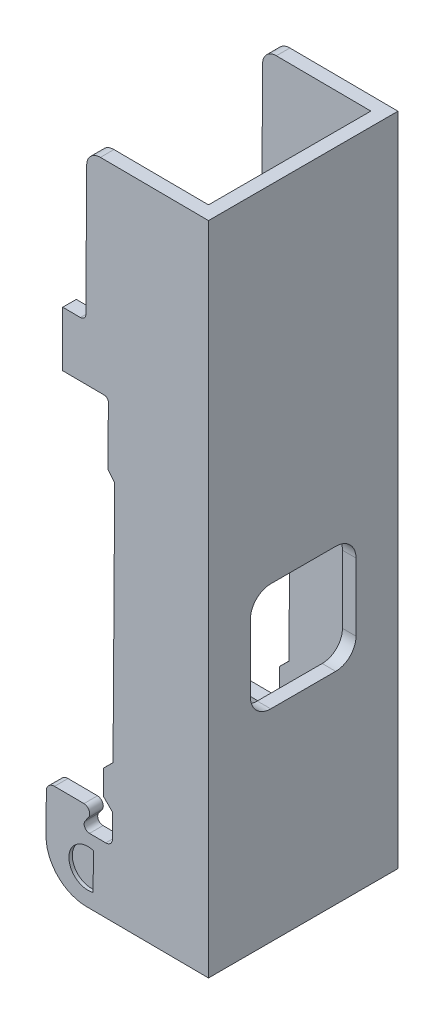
ISO-10303-21;
HEADER;
FILE_DESCRIPTION(('STEP AP214'),'2;1');
FILE_NAME('part.step','',(''),(''),'','','');
FILE_SCHEMA(('AUTOMOTIVE_DESIGN { 1 0 10303 214 1 1 1 1 }'));
ENDSEC;
DATA;
#1=APPLICATION_CONTEXT('core data for automotive mechanical design processes');
#2=APPLICATION_PROTOCOL_DEFINITION('international standard','automotive_design',2000,#1);
#3=PRODUCT_CONTEXT('',#1,'mechanical');
#4=PRODUCT('Part','Part','',(#3));
#5=PRODUCT_RELATED_PRODUCT_CATEGORY('part','',(#4));
#6=PRODUCT_DEFINITION_FORMATION('','',#4);
#7=PRODUCT_DEFINITION_CONTEXT('part definition',#1,'design');
#8=PRODUCT_DEFINITION('design','',#6,#7);
#9=PRODUCT_DEFINITION_SHAPE('','',#8);
#10=(LENGTH_UNIT() NAMED_UNIT(*) SI_UNIT(.MILLI.,.METRE.));
#11=(NAMED_UNIT(*) PLANE_ANGLE_UNIT() SI_UNIT($,.RADIAN.));
#12=(NAMED_UNIT(*) SI_UNIT($,.STERADIAN.) SOLID_ANGLE_UNIT());
#13=UNCERTAINTY_MEASURE_WITH_UNIT(LENGTH_MEASURE(1.E-05),#10,'distance_accuracy_value','');
#14=(GEOMETRIC_REPRESENTATION_CONTEXT(3) GLOBAL_UNCERTAINTY_ASSIGNED_CONTEXT((#13)) GLOBAL_UNIT_ASSIGNED_CONTEXT((#10,
#11,#12)) REPRESENTATION_CONTEXT('',''));
#15=CARTESIAN_POINT('',(0.,0.,0.));
#16=DIRECTION('',(0.,0.,1.));
#17=DIRECTION('',(1.,0.,0.));
#18=AXIS2_PLACEMENT_3D('',#15,#16,#17);
#19=CARTESIAN_POINT('',(-0.547448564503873,19.784952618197,6.75000000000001));
#20=DIRECTION('',(0.,0.,1.));
#21=DIRECTION('',(1.,0.,0.));
#22=AXIS2_PLACEMENT_3D('',#19,#20,#21);
#23=PLANE('',#22);
#24=CARTESIAN_POINT('',(-0.279763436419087,19.7831351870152,6.75000000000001));
#25=DIRECTION('',(0.,0.,-1.));
#26=DIRECTION('',(-1.,0.,0.));
#27=AXIS2_PLACEMENT_3D('',#24,#25,#26);
#28=CIRCLE('',#27,1.39999999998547);
#29=CARTESIAN_POINT('',(0.12933612,21.12202934,6.75000000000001));
#30=VERTEX_POINT('',#29);
#31=CARTESIAN_POINT('',(0.11111857,18.43880961,6.75000000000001));
#32=VERTEX_POINT('',#31);
#33=EDGE_CURVE('E19',#30,#32,#28,.F.);
#34=ORIENTED_EDGE('',*,*,#33,.T.);
#35=DIRECTION('',(0.00678928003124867,0.999976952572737,0.));
#36=VECTOR('',#35,1.);
#37=CARTESIAN_POINT('',(0.12933612,21.12202934,6.75000000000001));
#38=LINE('',#37,#36);
#39=EDGE_CURVE('E414',#32,#30,#38,.T.);
#40=ORIENTED_EDGE('',*,*,#39,.T.);
#41=EDGE_LOOP('',(#34,#40));
#42=FACE_BOUND('',#41,.T.);
#43=ADVANCED_FACE('F16',(#42),#23,.T.);
#44=CARTESIAN_POINT('',(-0.547448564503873,19.784952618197,-6.74999999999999));
#45=DIRECTION('',(0.,0.,1.));
#46=DIRECTION('',(1.,0.,0.));
#47=AXIS2_PLACEMENT_3D('',#44,#45,#46);
#48=PLANE('',#47);
#49=CARTESIAN_POINT('',(-0.279763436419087,19.7831351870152,-6.74999999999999));
#50=DIRECTION('',(0.,0.,-1.));
#51=DIRECTION('',(-1.,0.,0.));
#52=AXIS2_PLACEMENT_3D('',#49,#50,#51);
#53=CIRCLE('',#52,1.39999999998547);
#54=CARTESIAN_POINT('',(0.111118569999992,18.43880961,-6.74999999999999));
#55=VERTEX_POINT('',#54);
#56=CARTESIAN_POINT('',(0.129336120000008,21.1220293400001,-6.74999999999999));
#57=VERTEX_POINT('',#56);
#58=EDGE_CURVE('E601',#55,#57,#53,.T.);
#59=ORIENTED_EDGE('',*,*,#58,.T.);
#60=DIRECTION('',(0.00678928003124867,0.999976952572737,0.));
#61=VECTOR('',#60,1.);
#62=CARTESIAN_POINT('',(0.12933612,21.12202934,-6.74999999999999));
#63=LINE('',#62,#61);
#64=EDGE_CURVE('E435',#57,#55,#63,.F.);
#65=ORIENTED_EDGE('',*,*,#64,.T.);
#66=EDGE_LOOP('',(#59,#65));
#67=FACE_BOUND('',#66,.T.);
#68=ADVANCED_FACE('F1814',(#67),#48,.F.);
#69=CARTESIAN_POINT('',(-0.279763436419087,19.7831351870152,6.75000000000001));
#70=DIRECTION('',(0.,0.,-1.));
#71=DIRECTION('',(-1.,0.,0.));
#72=AXIS2_PLACEMENT_3D('',#69,#70,#71);
#73=CYLINDRICAL_SURFACE('',#72,1.39999999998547);
#74=ORIENTED_EDGE('',*,*,#33,.F.);
#75=DIRECTION('',(0.,0.,1.));
#76=VECTOR('',#75,1.);
#77=CARTESIAN_POINT('',(0.12933612,21.12202934,6.75000000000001));
#78=LINE('',#77,#76);
#79=CARTESIAN_POINT('',(0.12933612,21.12202934,7.));
#80=VERTEX_POINT('',#79);
#81=EDGE_CURVE('E429',#30,#80,#78,.T.);
#82=ORIENTED_EDGE('',*,*,#81,.T.);
#83=CARTESIAN_POINT('',(-0.279763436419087,19.7831351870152,7.));
#84=DIRECTION('',(0.,0.,-1.));
#85=DIRECTION('',(-1.,0.,0.));
#86=AXIS2_PLACEMENT_3D('',#83,#84,#85);
#87=CIRCLE('',#86,1.39999999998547);
#88=CARTESIAN_POINT('',(0.11111857,18.43880961,7.));
#89=VERTEX_POINT('',#88);
#90=EDGE_CURVE('E423',#89,#80,#87,.T.);
#91=ORIENTED_EDGE('',*,*,#90,.F.);
#92=DIRECTION('',(0.,0.,1.));
#93=VECTOR('',#92,1.);
#94=CARTESIAN_POINT('',(0.11111857,18.43880961,6.75000000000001));
#95=LINE('',#94,#93);
#96=EDGE_CURVE('E419',#89,#32,#95,.F.);
#97=ORIENTED_EDGE('',*,*,#96,.T.);
#98=EDGE_LOOP('',(#74,#82,#91,#97));
#99=FACE_BOUND('',#98,.T.);
#100=ADVANCED_FACE('F421',(#99),#73,.F.);
#101=CARTESIAN_POINT('',(0.12933612,21.12202934,6.75000000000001));
#102=DIRECTION('',(0.999976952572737,-0.00678928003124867,0.));
#103=DIRECTION('',(0.00678928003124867,0.999976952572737,0.));
#104=AXIS2_PLACEMENT_3D('',#101,#102,#103);
#105=PLANE('',#104);
#106=ORIENTED_EDGE('',*,*,#81,.F.);
#107=ORIENTED_EDGE('',*,*,#39,.F.);
#108=ORIENTED_EDGE('',*,*,#96,.F.);
#109=DIRECTION('',(-0.00678928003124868,-0.999976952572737,0.));
#110=VECTOR('',#109,1.);
#111=CARTESIAN_POINT('',(0.12933612,21.12202934,7.));
#112=LINE('',#111,#110);
#113=EDGE_CURVE('E519',#80,#89,#112,.T.);
#114=ORIENTED_EDGE('',*,*,#113,.F.);
#115=EDGE_LOOP('',(#106,#107,#108,#114));
#116=FACE_BOUND('',#115,.T.);
#117=ADVANCED_FACE('F428',(#116),#105,.F.);
#118=CARTESIAN_POINT('',(-0.430482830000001,55.15424893,-7.));
#119=DIRECTION('',(-0.999976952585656,0.00678927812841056,0.));
#120=DIRECTION('',(-0.00678927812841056,-0.999976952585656,0.));
#121=AXIS2_PLACEMENT_3D('',#118,#119,#120);
#122=PLANE('',#121);
#123=DIRECTION('',(-0.00678927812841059,-0.999976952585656,0.));
#124=VECTOR('',#123,1.);
#125=CARTESIAN_POINT('',(-0.36530576,64.75402767,7.));
#126=LINE('',#125,#124);
#127=CARTESIAN_POINT('',(-0.36530576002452,64.7540276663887,7.));
#128=VERTEX_POINT('',#127);
#129=CARTESIAN_POINT('',(-0.430482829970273,55.1542489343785,7.));
#130=VERTEX_POINT('',#129);
#131=EDGE_CURVE('E515',#128,#130,#126,.T.);
#132=ORIENTED_EDGE('',*,*,#131,.F.);
#133=DIRECTION('',(0.,0.,-1.));
#134=VECTOR('',#133,1.);
#135=CARTESIAN_POINT('',(-0.365305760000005,64.75402767,-7.));
#136=LINE('',#135,#134);
#137=CARTESIAN_POINT('',(-0.36530576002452,64.7540276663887,6.));
#138=VERTEX_POINT('',#137);
#139=EDGE_CURVE('E577',#138,#128,#136,.F.);
#140=ORIENTED_EDGE('',*,*,#139,.F.);
#141=DIRECTION('',(-0.00678927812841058,-0.999976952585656,0.));
#142=VECTOR('',#141,1.);
#143=CARTESIAN_POINT('',(-0.36530576,64.75402767,6.));
#144=LINE('',#143,#142);
#145=CARTESIAN_POINT('',(-0.430482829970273,55.1542489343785,6.));
#146=VERTEX_POINT('',#145);
#147=EDGE_CURVE('E600',#138,#146,#144,.T.);
#148=ORIENTED_EDGE('',*,*,#147,.T.);
#149=DIRECTION('',(0.,0.,-1.));
#150=VECTOR('',#149,1.);
#151=CARTESIAN_POINT('',(-0.43048283,55.15424893,-7.));
#152=LINE('',#151,#150);
#153=EDGE_CURVE('E431',#146,#130,#152,.F.);
#154=ORIENTED_EDGE('',*,*,#153,.T.);
#155=EDGE_LOOP('',(#132,#140,#148,#154));
#156=FACE_BOUND('',#155,.T.);
#157=ADVANCED_FACE('F1790',(#156),#122,.T.);
#158=CARTESIAN_POINT('',(-0.830473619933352,55.1569646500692,-7.));
#159=DIRECTION('',(0.,0.,-1.));
#160=DIRECTION('',(-1.,0.,0.));
#161=AXIS2_PLACEMENT_3D('',#158,#159,#160);
#162=CYLINDRICAL_SURFACE('',#161,0.400000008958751);
#163=DIRECTION('',(0.,0.,1.));
#164=VECTOR('',#163,1.);
#165=CARTESIAN_POINT('',(-0.833189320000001,54.75697386,-7.));
#166=LINE('',#165,#164);
#167=CARTESIAN_POINT('',(-0.833189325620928,54.7569738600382,7.));
#168=VERTEX_POINT('',#167);
#169=CARTESIAN_POINT('',(-0.833189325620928,54.7569738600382,6.));
#170=VERTEX_POINT('',#169);
#171=EDGE_CURVE('E736',#168,#170,#166,.F.);
#172=ORIENTED_EDGE('',*,*,#171,.F.);
#173=CARTESIAN_POINT('',(-0.830473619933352,55.1569646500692,7.));
#174=DIRECTION('',(0.,0.,-1.));
#175=DIRECTION('',(-1.,0.,0.));
#176=AXIS2_PLACEMENT_3D('',#173,#174,#175);
#177=CIRCLE('',#176,0.400000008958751);
#178=EDGE_CURVE('E511',#130,#168,#177,.T.);
#179=ORIENTED_EDGE('',*,*,#178,.F.);
#180=ORIENTED_EDGE('',*,*,#153,.F.);
#181=CARTESIAN_POINT('',(-0.830473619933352,55.1569646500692,6.));
#182=DIRECTION('',(0.,0.,-1.));
#183=DIRECTION('',(-1.,0.,0.));
#184=AXIS2_PLACEMENT_3D('',#181,#182,#183);
#185=CIRCLE('',#184,0.400000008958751);
#186=EDGE_CURVE('E598',#146,#170,#185,.T.);
#187=ORIENTED_EDGE('',*,*,#186,.T.);
#188=EDGE_LOOP('',(#172,#179,#180,#187));
#189=FACE_BOUND('',#188,.T.);
#190=ADVANCED_FACE('F1782',(#189),#162,.F.);
#191=CARTESIAN_POINT('',(-2.13503852,54.76581268,-7.));
#192=DIRECTION('',(0.00678927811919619,0.999976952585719,0.));
#193=DIRECTION('',(-0.999976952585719,0.00678927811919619,0.));
#194=AXIS2_PLACEMENT_3D('',#191,#192,#193);
#195=PLANE('',#194);
#196=DIRECTION('',(-0.999976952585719,0.00678927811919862,0.));
#197=VECTOR('',#196,1.);
#198=CARTESIAN_POINT('',(-0.833189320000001,54.75697386,7.));
#199=LINE('',#198,#197);
#200=CARTESIAN_POINT('',(-2.13503852,54.76581268,7.));
#201=VERTEX_POINT('',#200);
#202=EDGE_CURVE('E514',#168,#201,#199,.T.);
#203=ORIENTED_EDGE('',*,*,#202,.F.);
#204=ORIENTED_EDGE('',*,*,#171,.T.);
#205=DIRECTION('',(-0.999976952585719,0.00678927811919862,0.));
#206=VECTOR('',#205,1.);
#207=CARTESIAN_POINT('',(-0.833189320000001,54.75697386,6.));
#208=LINE('',#207,#206);
#209=CARTESIAN_POINT('',(-2.13503852,54.76581268,6.00000000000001));
#210=VERTEX_POINT('',#209);
#211=EDGE_CURVE('E599',#170,#210,#208,.T.);
#212=ORIENTED_EDGE('',*,*,#211,.T.);
#213=DIRECTION('',(0.,0.,1.));
#214=VECTOR('',#213,1.);
#215=CARTESIAN_POINT('',(-2.13503852,54.76581268,-7.));
#216=LINE('',#215,#214);
#217=EDGE_CURVE('E726',#201,#210,#216,.F.);
#218=ORIENTED_EDGE('',*,*,#217,.F.);
#219=EDGE_LOOP('',(#203,#204,#212,#218));
#220=FACE_BOUND('',#219,.T.);
#221=ADVANCED_FACE('F1774',(#220),#195,.T.);
#222=CARTESIAN_POINT('',(-2.16266596,50.69663122,-7.));
#223=DIRECTION('',(-0.999976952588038,0.00678927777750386,0.));
#224=DIRECTION('',(-0.00678927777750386,-0.999976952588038,0.));
#225=AXIS2_PLACEMENT_3D('',#222,#223,#224);
#226=PLANE('',#225);
#227=DIRECTION('',(-0.00678927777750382,-0.999976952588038,0.));
#228=VECTOR('',#227,1.);
#229=CARTESIAN_POINT('',(-2.13503852,54.76581268,7.));
#230=LINE('',#229,#228);
#231=CARTESIAN_POINT('',(-2.16266596,50.69663122,7.));
#232=VERTEX_POINT('',#231);
#233=EDGE_CURVE('E729',#201,#232,#230,.T.);
#234=ORIENTED_EDGE('',*,*,#233,.F.);
#235=ORIENTED_EDGE('',*,*,#217,.T.);
#236=DIRECTION('',(-0.00678927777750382,-0.999976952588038,0.));
#237=VECTOR('',#236,1.);
#238=CARTESIAN_POINT('',(-2.13503852,54.76581268,6.));
#239=LINE('',#238,#237);
#240=CARTESIAN_POINT('',(-2.16266596,50.69663122,6.));
#241=VERTEX_POINT('',#240);
#242=EDGE_CURVE('E806',#210,#241,#239,.T.);
#243=ORIENTED_EDGE('',*,*,#242,.T.);
#244=DIRECTION('',(0.,0.,1.));
#245=VECTOR('',#244,1.);
#246=CARTESIAN_POINT('',(-2.16266596,50.69663122,-7.));
#247=LINE('',#246,#245);
#248=EDGE_CURVE('E723',#232,#241,#247,.F.);
#249=ORIENTED_EDGE('',*,*,#248,.F.);
#250=EDGE_LOOP('',(#234,#235,#243,#249));
#251=FACE_BOUND('',#250,.T.);
#252=ADVANCED_FACE('F1765',(#251),#226,.T.);
#253=CARTESIAN_POINT('',(0.93726259,50.67558446,-7.));
#254=DIRECTION('',(-0.00678927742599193,-0.999976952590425,0.));
#255=DIRECTION('',(0.999976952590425,-0.00678927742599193,0.));
#256=AXIS2_PLACEMENT_3D('',#253,#254,#255);
#257=PLANE('',#256);
#258=DIRECTION('',(0.999976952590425,-0.00678927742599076,0.));
#259=VECTOR('',#258,1.);
#260=CARTESIAN_POINT('',(-2.16266596,50.69663122,7.));
#261=LINE('',#260,#259);
#262=CARTESIAN_POINT('',(0.937262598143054,50.6755844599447,7.));
#263=VERTEX_POINT('',#262);
#264=EDGE_CURVE('E510',#232,#263,#261,.T.);
#265=ORIENTED_EDGE('',*,*,#264,.F.);
#266=ORIENTED_EDGE('',*,*,#248,.T.);
#267=DIRECTION('',(0.999976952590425,-0.00678927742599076,0.));
#268=VECTOR('',#267,1.);
#269=CARTESIAN_POINT('',(-2.16266596,50.69663122,6.));
#270=LINE('',#269,#268);
#271=CARTESIAN_POINT('',(0.937262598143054,50.6755844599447,6.));
#272=VERTEX_POINT('',#271);
#273=EDGE_CURVE('E597',#241,#272,#270,.T.);
#274=ORIENTED_EDGE('',*,*,#273,.T.);
#275=DIRECTION('',(0.,0.,-1.));
#276=VECTOR('',#275,1.);
#277=CARTESIAN_POINT('',(0.93726259,50.67558446,-7.));
#278=LINE('',#277,#276);
#279=EDGE_CURVE('E721',#272,#263,#278,.F.);
#280=ORIENTED_EDGE('',*,*,#279,.T.);
#281=EDGE_LOOP('',(#265,#266,#274,#280));
#282=FACE_BOUND('',#281,.T.);
#283=ADVANCED_FACE('F1756',(#282),#257,.T.);
#284=CARTESIAN_POINT('',(0.935225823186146,50.3755913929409,-7.));
#285=DIRECTION('',(0.,0.,-1.));
#286=DIRECTION('',(-1.,0.,0.));
#287=AXIS2_PLACEMENT_3D('',#284,#285,#286);
#288=CYLINDRICAL_SURFACE('',#287,0.299999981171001);
#289=DIRECTION('',(0.,0.,1.));
#290=VECTOR('',#289,1.);
#291=CARTESIAN_POINT('',(1.23521889,50.37355459,-7.));
#292=LINE('',#291,#290);
#293=CARTESIAN_POINT('',(1.23521889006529,50.3735545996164,7.));
#294=VERTEX_POINT('',#293);
#295=CARTESIAN_POINT('',(1.23521889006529,50.3735545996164,6.));
#296=VERTEX_POINT('',#295);
#297=EDGE_CURVE('E716',#294,#296,#292,.F.);
#298=ORIENTED_EDGE('',*,*,#297,.F.);
#299=CARTESIAN_POINT('',(0.935225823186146,50.3755913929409,7.));
#300=DIRECTION('',(0.,0.,-1.));
#301=DIRECTION('',(-1.,0.,0.));
#302=AXIS2_PLACEMENT_3D('',#299,#300,#301);
#303=CIRCLE('',#302,0.299999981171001);
#304=EDGE_CURVE('E506',#263,#294,#303,.T.);
#305=ORIENTED_EDGE('',*,*,#304,.F.);
#306=ORIENTED_EDGE('',*,*,#279,.F.);
#307=CARTESIAN_POINT('',(0.935225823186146,50.3755913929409,6.));
#308=DIRECTION('',(0.,0.,-1.));
#309=DIRECTION('',(-1.,0.,0.));
#310=AXIS2_PLACEMENT_3D('',#307,#308,#309);
#311=CIRCLE('',#310,0.299999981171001);
#312=EDGE_CURVE('E594',#272,#296,#311,.T.);
#313=ORIENTED_EDGE('',*,*,#312,.T.);
#314=EDGE_LOOP('',(#298,#305,#306,#313));
#315=FACE_BOUND('',#314,.T.);
#316=ADVANCED_FACE('F1748',(#315),#288,.F.);
#317=CARTESIAN_POINT('',(1.20582131,46.04365439,-7.));
#318=DIRECTION('',(-0.999976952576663,0.00678927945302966,0.));
#319=DIRECTION('',(-0.00678927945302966,-0.999976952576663,0.));
#320=AXIS2_PLACEMENT_3D('',#317,#318,#319);
#321=PLANE('',#320);
#322=DIRECTION('',(-0.00678927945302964,-0.999976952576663,0.));
#323=VECTOR('',#322,1.);
#324=CARTESIAN_POINT('',(1.23521889,50.37355459,7.));
#325=LINE('',#324,#323);
#326=CARTESIAN_POINT('',(1.20582131,46.04365439,7.));
#327=VERTEX_POINT('',#326);
#328=EDGE_CURVE('E509',#294,#327,#325,.T.);
#329=ORIENTED_EDGE('',*,*,#328,.F.);
#330=ORIENTED_EDGE('',*,*,#297,.T.);
#331=DIRECTION('',(-0.00678927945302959,-0.999976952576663,0.));
#332=VECTOR('',#331,1.);
#333=CARTESIAN_POINT('',(1.23521889,50.37355459,6.));
#334=LINE('',#333,#332);
#335=CARTESIAN_POINT('',(1.20582131,46.04365439,6.));
#336=VERTEX_POINT('',#335);
#337=EDGE_CURVE('E596',#296,#336,#334,.T.);
#338=ORIENTED_EDGE('',*,*,#337,.T.);
#339=DIRECTION('',(0.,0.,1.));
#340=VECTOR('',#339,1.);
#341=CARTESIAN_POINT('',(1.20582131,46.04365439,-7.));
#342=LINE('',#341,#340);
#343=EDGE_CURVE('E707',#327,#336,#342,.F.);
#344=ORIENTED_EDGE('',*,*,#343,.F.);
#345=EDGE_LOOP('',(#329,#330,#338,#344));
#346=FACE_BOUND('',#345,.T.);
#347=ADVANCED_FACE('F1002',(#346),#321,.T.);
#348=CARTESIAN_POINT('',(1.70176421,45.44439669,-7.));
#349=DIRECTION('',(-0.770390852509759,-0.637571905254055,0.));
#350=DIRECTION('',(0.637571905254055,-0.770390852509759,0.));
#351=AXIS2_PLACEMENT_3D('',#348,#349,#350);
#352=PLANE('',#351);
#353=DIRECTION('',(0.637571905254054,-0.77039085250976,0.));
#354=VECTOR('',#353,1.);
#355=CARTESIAN_POINT('',(1.20582131,46.04365439,7.));
#356=LINE('',#355,#354);
#357=CARTESIAN_POINT('',(1.70176421,45.44439669,7.));
#358=VERTEX_POINT('',#357);
#359=EDGE_CURVE('E702',#327,#358,#356,.T.);
#360=ORIENTED_EDGE('',*,*,#359,.F.);
#361=ORIENTED_EDGE('',*,*,#343,.T.);
#362=DIRECTION('',(0.637571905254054,-0.77039085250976,0.));
#363=VECTOR('',#362,1.);
#364=CARTESIAN_POINT('',(1.20582131,46.04365439,6.));
#365=LINE('',#364,#363);
#366=CARTESIAN_POINT('',(1.70176421,45.44439669,6.));
#367=VERTEX_POINT('',#366);
#368=EDGE_CURVE('E800',#336,#367,#365,.T.);
#369=ORIENTED_EDGE('',*,*,#368,.T.);
#370=DIRECTION('',(0.,0.,1.));
#371=VECTOR('',#370,1.);
#372=CARTESIAN_POINT('',(1.70176421,45.44439669,-7.));
#373=LINE('',#372,#371);
#374=EDGE_CURVE('E697',#358,#367,#373,.F.);
#375=ORIENTED_EDGE('',*,*,#374,.F.);
#376=EDGE_LOOP('',(#360,#361,#369,#375));
#377=FACE_BOUND('',#376,.T.);
#378=ADVANCED_FACE('F1008',(#377),#352,.T.);
#379=CARTESIAN_POINT('',(1.57973288,27.47068774,-7.));
#380=DIRECTION('',(-0.999976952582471,0.00678927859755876,0.));
#381=DIRECTION('',(-0.00678927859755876,-0.999976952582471,0.));
#382=AXIS2_PLACEMENT_3D('',#379,#380,#381);
#383=PLANE('',#382);
#384=DIRECTION('',(-0.0067892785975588,-0.999976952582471,0.));
#385=VECTOR('',#384,1.);
#386=CARTESIAN_POINT('',(1.70176421,45.44439669,7.));
#387=LINE('',#386,#385);
#388=CARTESIAN_POINT('',(1.57973288,27.47068774,7.));
#389=VERTEX_POINT('',#388);
#390=EDGE_CURVE('E692',#358,#389,#387,.T.);
#391=ORIENTED_EDGE('',*,*,#390,.F.);
#392=ORIENTED_EDGE('',*,*,#374,.T.);
#393=DIRECTION('',(-0.0067892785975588,-0.999976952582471,0.));
#394=VECTOR('',#393,1.);
#395=CARTESIAN_POINT('',(1.70176421,45.44439669,6.));
#396=LINE('',#395,#394);
#397=CARTESIAN_POINT('',(1.57973288,27.47068774,6.));
#398=VERTEX_POINT('',#397);
#399=EDGE_CURVE('E796',#367,#398,#396,.T.);
#400=ORIENTED_EDGE('',*,*,#399,.T.);
#401=DIRECTION('',(0.,0.,1.));
#402=VECTOR('',#401,1.);
#403=CARTESIAN_POINT('',(1.57973288,27.47068774,-7.));
#404=LINE('',#403,#402);
#405=EDGE_CURVE('E687',#389,#398,#404,.F.);
#406=ORIENTED_EDGE('',*,*,#405,.F.);
#407=EDGE_LOOP('',(#391,#392,#400,#406));
#408=FACE_BOUND('',#407,.T.);
#409=ADVANCED_FACE('F1016',(#408),#383,.T.);
#410=CARTESIAN_POINT('',(0.87499652,26.77545637,-7.));
#411=DIRECTION('',(-0.702289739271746,0.711891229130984,0.));
#412=DIRECTION('',(-0.711891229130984,-0.702289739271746,0.));
#413=AXIS2_PLACEMENT_3D('',#410,#411,#412);
#414=PLANE('',#413);
#415=DIRECTION('',(-0.711891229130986,-0.702289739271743,0.));
#416=VECTOR('',#415,1.);
#417=CARTESIAN_POINT('',(1.57973288,27.47068774,7.));
#418=LINE('',#417,#416);
#419=CARTESIAN_POINT('',(0.87499652,26.77545637,7.));
#420=VERTEX_POINT('',#419);
#421=EDGE_CURVE('E682',#389,#420,#418,.T.);
#422=ORIENTED_EDGE('',*,*,#421,.F.);
#423=ORIENTED_EDGE('',*,*,#405,.T.);
#424=DIRECTION('',(-0.711891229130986,-0.702289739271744,0.));
#425=VECTOR('',#424,1.);
#426=CARTESIAN_POINT('',(1.57973288,27.47068774,6.));
#427=LINE('',#426,#425);
#428=CARTESIAN_POINT('',(0.87499652,26.77545637,6.));
#429=VERTEX_POINT('',#428);
#430=EDGE_CURVE('E792',#398,#429,#427,.T.);
#431=ORIENTED_EDGE('',*,*,#430,.T.);
#432=DIRECTION('',(0.,0.,1.));
#433=VECTOR('',#432,1.);
#434=CARTESIAN_POINT('',(0.87499652,26.77545637,-7.));
#435=LINE('',#434,#433);
#436=EDGE_CURVE('E677',#420,#429,#435,.F.);
#437=ORIENTED_EDGE('',*,*,#436,.F.);
#438=EDGE_LOOP('',(#422,#423,#431,#437));
#439=FACE_BOUND('',#438,.T.);
#440=ADVANCED_FACE('F1019',(#439),#414,.T.);
#441=CARTESIAN_POINT('',(0.86277582,24.97549786,-7.));
#442=DIRECTION('',(-0.999976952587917,0.00678927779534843,0.));
#443=DIRECTION('',(-0.00678927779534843,-0.999976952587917,0.));
#444=AXIS2_PLACEMENT_3D('',#441,#442,#443);
#445=PLANE('',#444);
#446=DIRECTION('',(-0.00678927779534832,-0.999976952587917,0.));
#447=VECTOR('',#446,1.);
#448=CARTESIAN_POINT('',(0.87499652,26.77545637,7.));
#449=LINE('',#448,#447);
#450=CARTESIAN_POINT('',(0.862775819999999,24.97549786,7.));
#451=VERTEX_POINT('',#450);
#452=EDGE_CURVE('E672',#420,#451,#449,.T.);
#453=ORIENTED_EDGE('',*,*,#452,.F.);
#454=ORIENTED_EDGE('',*,*,#436,.T.);
#455=DIRECTION('',(-0.00678927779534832,-0.999976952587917,0.));
#456=VECTOR('',#455,1.);
#457=CARTESIAN_POINT('',(0.87499652,26.77545637,6.));
#458=LINE('',#457,#456);
#459=CARTESIAN_POINT('',(0.862775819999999,24.97549786,6.));
#460=VERTEX_POINT('',#459);
#461=EDGE_CURVE('E788',#429,#460,#458,.T.);
#462=ORIENTED_EDGE('',*,*,#461,.T.);
#463=DIRECTION('',(0.,0.,1.));
#464=VECTOR('',#463,1.);
#465=CARTESIAN_POINT('',(0.862775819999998,24.97549786,-7.));
#466=LINE('',#465,#464);
#467=EDGE_CURVE('E666',#451,#460,#466,.F.);
#468=ORIENTED_EDGE('',*,*,#467,.F.);
#469=EDGE_LOOP('',(#453,#454,#462,#468));
#470=FACE_BOUND('',#469,.T.);
#471=ADVANCED_FACE('F1258',(#470),#445,.T.);
#472=CARTESIAN_POINT('',(1.55800719,24.2707615,-7.));
#473=DIRECTION('',(-0.711891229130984,-0.702289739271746,0.));
#474=DIRECTION('',(0.702289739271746,-0.711891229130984,0.));
#475=AXIS2_PLACEMENT_3D('',#472,#473,#474);
#476=PLANE('',#475);
#477=DIRECTION('',(0.702289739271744,-0.711891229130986,0.));
#478=VECTOR('',#477,1.);
#479=CARTESIAN_POINT('',(0.86277582,24.97549786,7.));
#480=LINE('',#479,#478);
#481=CARTESIAN_POINT('',(1.55800719,24.2707615,7.));
#482=VERTEX_POINT('',#481);
#483=EDGE_CURVE('E669',#451,#482,#480,.T.);
#484=ORIENTED_EDGE('',*,*,#483,.F.);
#485=ORIENTED_EDGE('',*,*,#467,.T.);
#486=DIRECTION('',(0.702289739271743,-0.711891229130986,0.));
#487=VECTOR('',#486,1.);
#488=CARTESIAN_POINT('',(0.86277582,24.97549786,6.));
#489=LINE('',#488,#487);
#490=CARTESIAN_POINT('',(1.55800719,24.2707615,6.));
#491=VERTEX_POINT('',#490);
#492=EDGE_CURVE('E786',#460,#491,#489,.T.);
#493=ORIENTED_EDGE('',*,*,#492,.T.);
#494=DIRECTION('',(0.,0.,1.));
#495=VECTOR('',#494,1.);
#496=CARTESIAN_POINT('',(1.55800719,24.2707615,-7.));
#497=LINE('',#496,#495);
#498=EDGE_CURVE('E663',#482,#491,#497,.F.);
#499=ORIENTED_EDGE('',*,*,#498,.F.);
#500=EDGE_LOOP('',(#484,#485,#493,#499));
#501=FACE_BOUND('',#500,.T.);
#502=ADVANCED_FACE('F1256',(#501),#476,.T.);
#503=CARTESIAN_POINT('',(1.54646542,22.57080068,-7.));
#504=DIRECTION('',(-0.999976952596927,0.00678927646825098,0.));
#505=DIRECTION('',(-0.00678927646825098,-0.999976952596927,0.));
#506=AXIS2_PLACEMENT_3D('',#503,#504,#505);
#507=PLANE('',#506);
#508=DIRECTION('',(-0.00678927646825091,-0.999976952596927,0.));
#509=VECTOR('',#508,1.);
#510=CARTESIAN_POINT('',(1.55800719,24.2707615,7.));
#511=LINE('',#510,#509);
#512=CARTESIAN_POINT('',(1.54646542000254,22.5708006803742,7.));
#513=VERTEX_POINT('',#512);
#514=EDGE_CURVE('E505',#482,#513,#511,.T.);
#515=ORIENTED_EDGE('',*,*,#514,.F.);
#516=ORIENTED_EDGE('',*,*,#498,.T.);
#517=DIRECTION('',(-0.00678927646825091,-0.999976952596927,0.));
#518=VECTOR('',#517,1.);
#519=CARTESIAN_POINT('',(1.55800719,24.2707615,6.));
#520=LINE('',#519,#518);
#521=CARTESIAN_POINT('',(1.54646542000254,22.5708006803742,6.));
#522=VERTEX_POINT('',#521);
#523=EDGE_CURVE('E593',#491,#522,#520,.T.);
#524=ORIENTED_EDGE('',*,*,#523,.T.);
#525=DIRECTION('',(0.,0.,-1.));
#526=VECTOR('',#525,1.);
#527=CARTESIAN_POINT('',(1.54646542,22.57080068,-7.));
#528=LINE('',#527,#526);
#529=EDGE_CURVE('E661',#522,#513,#528,.F.);
#530=ORIENTED_EDGE('',*,*,#529,.T.);
#531=EDGE_LOOP('',(#515,#516,#524,#530));
#532=FACE_BOUND('',#531,.T.);
#533=ADVANCED_FACE('F1215',(#532),#507,.T.);
#534=CARTESIAN_POINT('',(1.04647694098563,22.5741953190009,-7.));
#535=DIRECTION('',(0.,0.,-1.));
#536=DIRECTION('',(-1.,0.,0.));
#537=AXIS2_PLACEMENT_3D('',#534,#535,#536);
#538=CYLINDRICAL_SURFACE('',#537,0.500000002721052);
#539=DIRECTION('',(0.,0.,1.));
#540=VECTOR('',#539,1.);
#541=CARTESIAN_POINT('',(1.0430823,22.07420684,-7.));
#542=LINE('',#541,#540);
#543=CARTESIAN_POINT('',(1.04308230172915,22.0742068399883,7.));
#544=VERTEX_POINT('',#543);
#545=CARTESIAN_POINT('',(1.04308230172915,22.0742068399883,6.));
#546=VERTEX_POINT('',#545);
#547=EDGE_CURVE('E658',#544,#546,#542,.F.);
#548=ORIENTED_EDGE('',*,*,#547,.F.);
#549=CARTESIAN_POINT('',(1.04647694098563,22.5741953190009,7.));
#550=DIRECTION('',(0.,0.,-1.));
#551=DIRECTION('',(-1.,0.,0.));
#552=AXIS2_PLACEMENT_3D('',#549,#550,#551);
#553=CIRCLE('',#552,0.500000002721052);
#554=EDGE_CURVE('E502',#513,#544,#553,.T.);
#555=ORIENTED_EDGE('',*,*,#554,.F.);
#556=ORIENTED_EDGE('',*,*,#529,.F.);
#557=CARTESIAN_POINT('',(1.04647694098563,22.5741953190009,6.));
#558=DIRECTION('',(0.,0.,-1.));
#559=DIRECTION('',(-1.,0.,0.));
#560=AXIS2_PLACEMENT_3D('',#557,#558,#559);
#561=CIRCLE('',#560,0.500000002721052);
#562=EDGE_CURVE('E591',#522,#546,#561,.T.);
#563=ORIENTED_EDGE('',*,*,#562,.T.);
#564=EDGE_LOOP('',(#548,#555,#556,#563));
#565=FACE_BOUND('',#564,.T.);
#566=ADVANCED_FACE('F1220',(#565),#538,.F.);
#567=CARTESIAN_POINT('',(-0.15689004,22.08235397,-7.));
#568=DIRECTION('',(0.00678927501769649,0.999976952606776,0.));
#569=DIRECTION('',(-0.999976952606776,0.00678927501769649,0.));
#570=AXIS2_PLACEMENT_3D('',#567,#568,#569);
#571=PLANE('',#570);
#572=DIRECTION('',(-0.999976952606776,0.00678927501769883,0.));
#573=VECTOR('',#572,1.);
#574=CARTESIAN_POINT('',(1.0430823,22.07420684,7.));
#575=LINE('',#574,#573);
#576=CARTESIAN_POINT('',(-0.156890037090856,22.0823539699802,7.));
#577=VERTEX_POINT('',#576);
#578=EDGE_CURVE('E501',#544,#577,#575,.T.);
#579=ORIENTED_EDGE('',*,*,#578,.F.);
#580=ORIENTED_EDGE('',*,*,#547,.T.);
#581=DIRECTION('',(-0.999976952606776,0.00678927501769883,0.));
#582=VECTOR('',#581,1.);
#583=CARTESIAN_POINT('',(1.0430823,22.07420684,6.));
#584=LINE('',#583,#582);
#585=CARTESIAN_POINT('',(-0.156890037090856,22.0823539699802,6.));
#586=VERTEX_POINT('',#585);
#587=EDGE_CURVE('E590',#546,#586,#584,.T.);
#588=ORIENTED_EDGE('',*,*,#587,.T.);
#589=DIRECTION('',(0.,0.,-1.));
#590=VECTOR('',#589,1.);
#591=CARTESIAN_POINT('',(-0.15689004,22.08235397,-7.));
#592=LINE('',#591,#590);
#593=EDGE_CURVE('E656',#586,#577,#592,.F.);
#594=ORIENTED_EDGE('',*,*,#593,.T.);
#595=EDGE_LOOP('',(#579,#580,#588,#594));
#596=FACE_BOUND('',#595,.T.);
#597=ADVANCED_FACE('F1224',(#596),#571,.T.);
#598=CARTESIAN_POINT('',(-0.154174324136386,22.4823447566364,-7.));
#599=DIRECTION('',(0.,0.,-1.));
#600=DIRECTION('',(-1.,0.,0.));
#601=AXIS2_PLACEMENT_3D('',#598,#599,#600);
#602=CYLINDRICAL_SURFACE('',#601,0.400000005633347);
#603=DIRECTION('',(0.,0.,1.));
#604=VECTOR('',#603,1.);
#605=CARTESIAN_POINT('',(-0.481874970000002,22.71171845,-7.));
#606=LINE('',#605,#604);
#607=CARTESIAN_POINT('',(-0.481874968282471,22.7117184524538,7.));
#608=VERTEX_POINT('',#607);
#609=CARTESIAN_POINT('',(-0.481874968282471,22.7117184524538,6.));
#610=VERTEX_POINT('',#609);
#611=EDGE_CURVE('E653',#608,#610,#606,.F.);
#612=ORIENTED_EDGE('',*,*,#611,.F.);
#613=CARTESIAN_POINT('',(-0.154174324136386,22.4823447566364,7.));
#614=DIRECTION('',(0.,0.,-1.));
#615=DIRECTION('',(-1.,0.,0.));
#616=AXIS2_PLACEMENT_3D('',#613,#614,#615);
#617=CIRCLE('',#616,0.400000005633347);
#618=EDGE_CURVE('E498',#577,#608,#617,.T.);
#619=ORIENTED_EDGE('',*,*,#618,.F.);
#620=ORIENTED_EDGE('',*,*,#593,.F.);
#621=CARTESIAN_POINT('',(-0.154174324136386,22.4823447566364,6.));
#622=DIRECTION('',(0.,0.,-1.));
#623=DIRECTION('',(-1.,0.,0.));
#624=AXIS2_PLACEMENT_3D('',#621,#622,#623);
#625=CIRCLE('',#624,0.400000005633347);
#626=EDGE_CURVE('E588',#586,#610,#625,.T.);
#627=ORIENTED_EDGE('',*,*,#626,.T.);
#628=EDGE_LOOP('',(#612,#619,#620,#627));
#629=FACE_BOUND('',#628,.T.);
#630=ADVANCED_FACE('F1229',(#629),#602,.F.);
#631=CARTESIAN_POINT('',(-0.24103259,23.05580412,-7.));
#632=DIRECTION('',(0.819251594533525,-0.573434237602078,0.));
#633=DIRECTION('',(0.573434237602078,0.819251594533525,0.));
#634=AXIS2_PLACEMENT_3D('',#631,#632,#633);
#635=PLANE('',#634);
#636=DIRECTION('',(0.573434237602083,0.819251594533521,0.));
#637=VECTOR('',#636,1.);
#638=CARTESIAN_POINT('',(-0.481874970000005,22.71171845,7.));
#639=LINE('',#638,#637);
#640=CARTESIAN_POINT('',(-0.241032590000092,23.0558041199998,7.));
#641=VERTEX_POINT('',#640);
#642=EDGE_CURVE('E497',#608,#641,#639,.T.);
#643=ORIENTED_EDGE('',*,*,#642,.F.);
#644=ORIENTED_EDGE('',*,*,#611,.T.);
#645=DIRECTION('',(0.573434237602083,0.819251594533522,0.));
#646=VECTOR('',#645,1.);
#647=CARTESIAN_POINT('',(-0.481874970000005,22.71171845,6.));
#648=LINE('',#647,#646);
#649=CARTESIAN_POINT('',(-0.241032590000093,23.0558041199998,6.));
#650=VERTEX_POINT('',#649);
#651=EDGE_CURVE('E587',#610,#650,#648,.T.);
#652=ORIENTED_EDGE('',*,*,#651,.T.);
#653=DIRECTION('',(0.,0.,-1.));
#654=VECTOR('',#653,1.);
#655=CARTESIAN_POINT('',(-0.24103258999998,23.05580412,-7.));
#656=LINE('',#655,#654);
#657=EDGE_CURVE('E650',#641,#650,#656,.T.);
#658=ORIENTED_EDGE('',*,*,#657,.F.);
#659=EDGE_LOOP('',(#643,#644,#652,#658));
#660=FACE_BOUND('',#659,.T.);
#661=ADVANCED_FACE('F1233',(#660),#635,.T.);
#662=CARTESIAN_POINT('',(-0.587804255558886,23.338395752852,-7.));
#663=DIRECTION('',(0.,0.,-1.));
#664=DIRECTION('',(-1.,0.,0.));
#665=AXIS2_PLACEMENT_3D('',#662,#663,#664);
#666=CYLINDRICAL_SURFACE('',#665,0.447335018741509);
#667=CARTESIAN_POINT('',(-0.587804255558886,23.338395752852,7.));
#668=DIRECTION('',(0.,0.,-1.));
#669=DIRECTION('',(-1.,0.,0.));
#670=AXIS2_PLACEMENT_3D('',#667,#668,#669);
#671=CIRCLE('',#670,0.447335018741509);
#672=CARTESIAN_POINT('',(-0.565338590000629,23.78516629,7.));
#673=VERTEX_POINT('',#672);
#674=EDGE_CURVE('E494',#641,#673,#671,.F.);
#675=ORIENTED_EDGE('',*,*,#674,.F.);
#676=ORIENTED_EDGE('',*,*,#657,.T.);
#677=CARTESIAN_POINT('',(-0.587804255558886,23.338395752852,6.));
#678=DIRECTION('',(0.,0.,-1.));
#679=DIRECTION('',(-1.,0.,0.));
#680=AXIS2_PLACEMENT_3D('',#677,#678,#679);
#681=CIRCLE('',#680,0.447335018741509);
#682=CARTESIAN_POINT('',(-0.565338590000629,23.78516629,6.));
#683=VERTEX_POINT('',#682);
#684=EDGE_CURVE('E585',#650,#683,#681,.F.);
#685=ORIENTED_EDGE('',*,*,#684,.T.);
#686=DIRECTION('',(0.,0.,1.));
#687=VECTOR('',#686,1.);
#688=CARTESIAN_POINT('',(-0.565338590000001,23.78516629,-7.));
#689=LINE('',#688,#687);
#690=EDGE_CURVE('E647',#673,#683,#689,.F.);
#691=ORIENTED_EDGE('',*,*,#690,.F.);
#692=EDGE_LOOP('',(#675,#676,#685,#691));
#693=FACE_BOUND('',#692,.T.);
#694=ADVANCED_FACE('F1237',(#693),#666,.T.);
#695=CARTESIAN_POINT('',(-2.74528835,23.79996692,-7.));
#696=DIRECTION('',(0.00678927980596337,0.999976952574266,0.));
#697=DIRECTION('',(-0.999976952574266,0.00678927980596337,0.));
#698=AXIS2_PLACEMENT_3D('',#695,#696,#697);
#699=PLANE('',#698);
#700=DIRECTION('',(-0.999976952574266,0.00678927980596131,0.));
#701=VECTOR('',#700,1.);
#702=CARTESIAN_POINT('',(-0.565338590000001,23.78516629,7.));
#703=LINE('',#702,#701);
#704=CARTESIAN_POINT('',(-2.74528835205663,23.799966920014,7.));
#705=VERTEX_POINT('',#704);
#706=EDGE_CURVE('E493',#673,#705,#703,.T.);
#707=ORIENTED_EDGE('',*,*,#706,.F.);
#708=ORIENTED_EDGE('',*,*,#690,.T.);
#709=DIRECTION('',(-0.999976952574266,0.00678927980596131,0.));
#710=VECTOR('',#709,1.);
#711=CARTESIAN_POINT('',(-0.565338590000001,23.78516629,6.));
#712=LINE('',#711,#710);
#713=CARTESIAN_POINT('',(-2.74528835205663,23.799966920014,6.));
#714=VERTEX_POINT('',#713);
#715=EDGE_CURVE('E584',#683,#714,#712,.T.);
#716=ORIENTED_EDGE('',*,*,#715,.T.);
#717=DIRECTION('',(0.,0.,-1.));
#718=VECTOR('',#717,1.);
#719=CARTESIAN_POINT('',(-2.74528835,23.79996692,-7.));
#720=LINE('',#719,#718);
#721=EDGE_CURVE('E644',#705,#714,#720,.T.);
#722=ORIENTED_EDGE('',*,*,#721,.F.);
#723=EDGE_LOOP('',(#707,#708,#716,#722));
#724=FACE_BOUND('',#723,.T.);
#725=ADVANCED_FACE('F1241',(#724),#699,.T.);
#726=CARTESIAN_POINT('',(-2.74936192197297,23.199980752,-7.));
#727=DIRECTION('',(0.,0.,-1.));
#728=DIRECTION('',(-1.,0.,0.));
#729=AXIS2_PLACEMENT_3D('',#726,#727,#728);
#730=CYLINDRICAL_SURFACE('',#729,0.599999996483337);
#731=CARTESIAN_POINT('',(-2.74936192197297,23.199980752,7.));
#732=DIRECTION('',(0.,0.,-1.));
#733=DIRECTION('',(-1.,0.,0.));
#734=AXIS2_PLACEMENT_3D('',#731,#732,#733);
#735=CIRCLE('',#734,0.599999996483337);
#736=CARTESIAN_POINT('',(-3.34934809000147,23.2040543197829,7.));
#737=VERTEX_POINT('',#736);
#738=EDGE_CURVE('E490',#705,#737,#735,.F.);
#739=ORIENTED_EDGE('',*,*,#738,.F.);
#740=ORIENTED_EDGE('',*,*,#721,.T.);
#741=CARTESIAN_POINT('',(-2.74936192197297,23.199980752,6.));
#742=DIRECTION('',(0.,0.,-1.));
#743=DIRECTION('',(-1.,0.,0.));
#744=AXIS2_PLACEMENT_3D('',#741,#742,#743);
#745=CIRCLE('',#744,0.599999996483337);
#746=CARTESIAN_POINT('',(-3.34934809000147,23.2040543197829,6.));
#747=VERTEX_POINT('',#746);
#748=EDGE_CURVE('E582',#714,#747,#745,.F.);
#749=ORIENTED_EDGE('',*,*,#748,.T.);
#750=DIRECTION('',(0.,0.,1.));
#751=VECTOR('',#750,1.);
#752=CARTESIAN_POINT('',(-3.34934809,23.20405432,-7.));
#753=LINE('',#752,#751);
#754=EDGE_CURVE('E639',#737,#747,#753,.F.);
#755=ORIENTED_EDGE('',*,*,#754,.F.);
#756=EDGE_LOOP('',(#739,#740,#749,#755));
#757=FACE_BOUND('',#756,.T.);
#758=ADVANCED_FACE('F1245',(#757),#730,.T.);
#759=CARTESIAN_POINT('',(-3.369037,20.30412116,-7.));
#760=DIRECTION('',(-0.999976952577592,0.00678927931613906,0.));
#761=DIRECTION('',(-0.00678927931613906,-0.999976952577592,0.));
#762=AXIS2_PLACEMENT_3D('',#759,#760,#761);
#763=PLANE('',#762);
#764=DIRECTION('',(-0.00678927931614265,-0.999976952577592,0.));
#765=VECTOR('',#764,1.);
#766=CARTESIAN_POINT('',(-3.34934808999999,23.20405432,7.));
#767=LINE('',#766,#765);
#768=CARTESIAN_POINT('',(-3.36903699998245,20.3041211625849,7.));
#769=VERTEX_POINT('',#768);
#770=EDGE_CURVE('E489',#737,#769,#767,.T.);
#771=ORIENTED_EDGE('',*,*,#770,.F.);
#772=ORIENTED_EDGE('',*,*,#754,.T.);
#773=DIRECTION('',(-0.00678927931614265,-0.999976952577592,0.));
#774=VECTOR('',#773,1.);
#775=CARTESIAN_POINT('',(-3.34934808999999,23.20405432,6.));
#776=LINE('',#775,#774);
#777=CARTESIAN_POINT('',(-3.36903699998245,20.3041211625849,6.));
#778=VERTEX_POINT('',#777);
#779=EDGE_CURVE('E581',#747,#778,#776,.T.);
#780=ORIENTED_EDGE('',*,*,#779,.T.);
#781=DIRECTION('',(0.,0.,-1.));
#782=VECTOR('',#781,1.);
#783=CARTESIAN_POINT('',(-3.369037,20.30412116,-7.));
#784=LINE('',#783,#782);
#785=EDGE_CURVE('E614',#769,#778,#784,.T.);
#786=ORIENTED_EDGE('',*,*,#785,.F.);
#787=EDGE_LOOP('',(#771,#772,#780,#786));
#788=FACE_BOUND('',#787,.T.);
#789=ADVANCED_FACE('F1249',(#788),#763,.T.);
#790=CARTESIAN_POINT('',(-0.369106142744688,20.2837533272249,-7.));
#791=DIRECTION('',(0.,0.,-1.));
#792=DIRECTION('',(-1.,0.,0.));
#793=AXIS2_PLACEMENT_3D('',#790,#791,#792);
#794=CYLINDRICAL_SURFACE('',#793,2.99999999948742);
#795=CARTESIAN_POINT('',(-0.369106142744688,20.2837533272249,7.));
#796=DIRECTION('',(0.,0.,-1.));
#797=DIRECTION('',(-1.,0.,0.));
#798=AXIS2_PLACEMENT_3D('',#795,#796,#797);
#799=CIRCLE('',#798,2.99999999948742);
#800=CARTESIAN_POINT('',(-0.389473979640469,17.2838224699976,7.));
#801=VERTEX_POINT('',#800);
#802=EDGE_CURVE('E485',#769,#801,#799,.F.);
#803=ORIENTED_EDGE('',*,*,#802,.F.);
#804=ORIENTED_EDGE('',*,*,#785,.T.);
#805=CARTESIAN_POINT('',(-0.369106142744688,20.2837533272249,6.));
#806=DIRECTION('',(0.,0.,-1.));
#807=DIRECTION('',(-1.,0.,0.));
#808=AXIS2_PLACEMENT_3D('',#805,#806,#807);
#809=CIRCLE('',#808,2.99999999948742);
#810=CARTESIAN_POINT('',(-0.389473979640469,17.2838224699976,6.));
#811=VERTEX_POINT('',#810);
#812=EDGE_CURVE('E578',#778,#811,#809,.F.);
#813=ORIENTED_EDGE('',*,*,#812,.T.);
#814=DIRECTION('',(0.,0.,-1.));
#815=VECTOR('',#814,1.);
#816=CARTESIAN_POINT('',(-0.389473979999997,17.28382247,-7.));
#817=LINE('',#816,#815);
#818=EDGE_CURVE('E637',#811,#801,#817,.F.);
#819=ORIENTED_EDGE('',*,*,#818,.T.);
#820=EDGE_LOOP('',(#803,#804,#813,#819));
#821=FACE_BOUND('',#820,.T.);
#822=ADVANCED_FACE('F1253',(#821),#794,.T.);
#823=CARTESIAN_POINT('',(0.12933612,21.12202934,-11.75));
#824=DIRECTION('',(0.999976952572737,-0.00678928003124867,0.));
#825=DIRECTION('',(0.00678928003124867,0.999976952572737,0.));
#826=AXIS2_PLACEMENT_3D('',#823,#824,#825);
#827=PLANE('',#826);
#828=DIRECTION('',(0.,0.,-1.));
#829=VECTOR('',#828,1.);
#830=CARTESIAN_POINT('',(0.111118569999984,18.43880961,-11.75));
#831=LINE('',#830,#829);
#832=CARTESIAN_POINT('',(0.111118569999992,18.43880961,-7.));
#833=VERTEX_POINT('',#832);
#834=EDGE_CURVE('E603',#833,#55,#831,.F.);
#835=ORIENTED_EDGE('',*,*,#834,.T.);
#836=ORIENTED_EDGE('',*,*,#64,.F.);
#837=DIRECTION('',(0.,0.,-1.));
#838=VECTOR('',#837,1.);
#839=CARTESIAN_POINT('',(0.129336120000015,21.1220293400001,-11.75));
#840=LINE('',#839,#838);
#841=CARTESIAN_POINT('',(0.129336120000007,21.1220293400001,-7.));
#842=VERTEX_POINT('',#841);
#843=EDGE_CURVE('E602',#57,#842,#840,.T.);
#844=ORIENTED_EDGE('',*,*,#843,.T.);
#845=DIRECTION('',(-0.00678928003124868,-0.999976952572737,0.));
#846=VECTOR('',#845,1.);
#847=CARTESIAN_POINT('',(0.12933612,21.12202934,-7.));
#848=LINE('',#847,#846);
#849=EDGE_CURVE('E484',#842,#833,#848,.T.);
#850=ORIENTED_EDGE('',*,*,#849,.T.);
#851=EDGE_LOOP('',(#835,#836,#844,#850));
#852=FACE_BOUND('',#851,.T.);
#853=ADVANCED_FACE('F1372',(#852),#827,.F.);
#854=CARTESIAN_POINT('',(-0.279763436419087,19.7831351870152,-11.75));
#855=DIRECTION('',(0.,0.,-1.));
#856=DIRECTION('',(-1.,0.,0.));
#857=AXIS2_PLACEMENT_3D('',#854,#855,#856);
#858=CYLINDRICAL_SURFACE('',#857,1.39999999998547);
#859=CARTESIAN_POINT('',(-0.279763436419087,19.7831351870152,-7.));
#860=DIRECTION('',(0.,0.,-1.));
#861=DIRECTION('',(-1.,0.,0.));
#862=AXIS2_PLACEMENT_3D('',#859,#860,#861);
#863=CIRCLE('',#862,1.39999999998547);
#864=EDGE_CURVE('E481',#833,#842,#863,.T.);
#865=ORIENTED_EDGE('',*,*,#864,.T.);
#866=ORIENTED_EDGE('',*,*,#843,.F.);
#867=ORIENTED_EDGE('',*,*,#58,.F.);
#868=ORIENTED_EDGE('',*,*,#834,.F.);
#869=EDGE_LOOP('',(#865,#866,#867,#868));
#870=FACE_BOUND('',#869,.T.);
#871=ADVANCED_FACE('F1369',(#870),#858,.F.);
#872=CARTESIAN_POINT('',(-0.430482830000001,55.15424893,-7.));
#873=DIRECTION('',(-0.999976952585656,0.00678927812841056,0.));
#874=DIRECTION('',(-0.00678927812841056,-0.999976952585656,0.));
#875=AXIS2_PLACEMENT_3D('',#872,#873,#874);
#876=PLANE('',#875);
#877=DIRECTION('',(-0.00678927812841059,-0.999976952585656,0.));
#878=VECTOR('',#877,1.);
#879=CARTESIAN_POINT('',(-0.36530576,64.75402767,-7.));
#880=LINE('',#879,#878);
#881=CARTESIAN_POINT('',(-0.36530576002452,64.7540276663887,-7.));
#882=VERTEX_POINT('',#881);
#883=CARTESIAN_POINT('',(-0.430482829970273,55.1542489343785,-7.));
#884=VERTEX_POINT('',#883);
#885=EDGE_CURVE('E477',#882,#884,#880,.T.);
#886=ORIENTED_EDGE('',*,*,#885,.T.);
#887=DIRECTION('',(0.,0.,-1.));
#888=VECTOR('',#887,1.);
#889=CARTESIAN_POINT('',(-0.43048283,55.15424893,-7.));
#890=LINE('',#889,#888);
#891=CARTESIAN_POINT('',(-0.430482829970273,55.1542489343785,-6.));
#892=VERTEX_POINT('',#891);
#893=EDGE_CURVE('E607',#884,#892,#890,.F.);
#894=ORIENTED_EDGE('',*,*,#893,.T.);
#895=DIRECTION('',(-0.00678927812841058,-0.999976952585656,0.));
#896=VECTOR('',#895,1.);
#897=CARTESIAN_POINT('',(-0.36530576,64.75402767,-6.));
#898=LINE('',#897,#896);
#899=CARTESIAN_POINT('',(-0.36530576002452,64.7540276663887,-6.));
#900=VERTEX_POINT('',#899);
#901=EDGE_CURVE('E569',#900,#892,#898,.T.);
#902=ORIENTED_EDGE('',*,*,#901,.F.);
#903=DIRECTION('',(0.,0.,-1.));
#904=VECTOR('',#903,1.);
#905=CARTESIAN_POINT('',(-0.365305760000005,64.75402767,-7.));
#906=LINE('',#905,#904);
#907=EDGE_CURVE('E573',#882,#900,#906,.F.);
#908=ORIENTED_EDGE('',*,*,#907,.F.);
#909=EDGE_LOOP('',(#886,#894,#902,#908));
#910=FACE_BOUND('',#909,.T.);
#911=ADVANCED_FACE('F936',(#910),#876,.T.);
#912=CARTESIAN_POINT('',(-0.830473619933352,55.1569646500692,-7.));
#913=DIRECTION('',(0.,0.,-1.));
#914=DIRECTION('',(-1.,0.,0.));
#915=AXIS2_PLACEMENT_3D('',#912,#913,#914);
#916=CYLINDRICAL_SURFACE('',#915,0.400000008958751);
#917=ORIENTED_EDGE('',*,*,#893,.F.);
#918=CARTESIAN_POINT('',(-0.830473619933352,55.1569646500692,-7.));
#919=DIRECTION('',(0.,0.,-1.));
#920=DIRECTION('',(-1.,0.,0.));
#921=AXIS2_PLACEMENT_3D('',#918,#919,#920);
#922=CIRCLE('',#921,0.400000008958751);
#923=CARTESIAN_POINT('',(-0.833189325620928,54.7569738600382,-7.));
#924=VERTEX_POINT('',#923);
#925=EDGE_CURVE('E474',#884,#924,#922,.T.);
#926=ORIENTED_EDGE('',*,*,#925,.T.);
#927=DIRECTION('',(0.,0.,1.));
#928=VECTOR('',#927,1.);
#929=CARTESIAN_POINT('',(-0.833189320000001,54.75697386,-7.));
#930=LINE('',#929,#928);
#931=CARTESIAN_POINT('',(-0.833189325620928,54.7569738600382,-6.));
#932=VERTEX_POINT('',#931);
#933=EDGE_CURVE('E923',#932,#924,#930,.F.);
#934=ORIENTED_EDGE('',*,*,#933,.F.);
#935=CARTESIAN_POINT('',(-0.830473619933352,55.1569646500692,-6.));
#936=DIRECTION('',(0.,0.,-1.));
#937=DIRECTION('',(-1.,0.,0.));
#938=AXIS2_PLACEMENT_3D('',#935,#936,#937);
#939=CIRCLE('',#938,0.400000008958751);
#940=EDGE_CURVE('E565',#892,#932,#939,.T.);
#941=ORIENTED_EDGE('',*,*,#940,.F.);
#942=EDGE_LOOP('',(#917,#926,#934,#941));
#943=FACE_BOUND('',#942,.T.);
#944=ADVANCED_FACE('F1363',(#943),#916,.F.);
#945=CARTESIAN_POINT('',(-2.13503852,54.76581268,-7.));
#946=DIRECTION('',(0.00678927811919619,0.999976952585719,0.));
#947=DIRECTION('',(-0.999976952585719,0.00678927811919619,0.));
#948=AXIS2_PLACEMENT_3D('',#945,#946,#947);
#949=PLANE('',#948);
#950=DIRECTION('',(-0.999976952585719,0.00678927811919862,0.));
#951=VECTOR('',#950,1.);
#952=CARTESIAN_POINT('',(-0.833189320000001,54.75697386,-7.));
#953=LINE('',#952,#951);
#954=CARTESIAN_POINT('',(-2.13503852,54.76581268,-7.));
#955=VERTEX_POINT('',#954);
#956=EDGE_CURVE('E476',#924,#955,#953,.T.);
#957=ORIENTED_EDGE('',*,*,#956,.T.);
#958=DIRECTION('',(0.,0.,1.));
#959=VECTOR('',#958,1.);
#960=CARTESIAN_POINT('',(-2.13503852,54.76581268,-7.));
#961=LINE('',#960,#959);
#962=CARTESIAN_POINT('',(-2.13503852,54.76581268,-6.));
#963=VERTEX_POINT('',#962);
#964=EDGE_CURVE('E914',#963,#955,#961,.F.);
#965=ORIENTED_EDGE('',*,*,#964,.F.);
#966=DIRECTION('',(-0.999976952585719,0.00678927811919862,0.));
#967=VECTOR('',#966,1.);
#968=CARTESIAN_POINT('',(-0.833189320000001,54.75697386,-6.));
#969=LINE('',#968,#967);
#970=EDGE_CURVE('E568',#932,#963,#969,.T.);
#971=ORIENTED_EDGE('',*,*,#970,.F.);
#972=ORIENTED_EDGE('',*,*,#933,.T.);
#973=EDGE_LOOP('',(#957,#965,#971,#972));
#974=FACE_BOUND('',#973,.T.);
#975=ADVANCED_FACE('F1077',(#974),#949,.T.);
#976=CARTESIAN_POINT('',(-2.16266596,50.69663122,-7.));
#977=DIRECTION('',(-0.999976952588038,0.00678927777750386,0.));
#978=DIRECTION('',(-0.00678927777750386,-0.999976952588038,0.));
#979=AXIS2_PLACEMENT_3D('',#976,#977,#978);
#980=PLANE('',#979);
#981=DIRECTION('',(-0.00678927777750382,-0.999976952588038,0.));
#982=VECTOR('',#981,1.);
#983=CARTESIAN_POINT('',(-2.13503852,54.76581268,-7.));
#984=LINE('',#983,#982);
#985=CARTESIAN_POINT('',(-2.16266596,50.69663122,-7.));
#986=VERTEX_POINT('',#985);
#987=EDGE_CURVE('E917',#955,#986,#984,.T.);
#988=ORIENTED_EDGE('',*,*,#987,.T.);
#989=DIRECTION('',(0.,0.,1.));
#990=VECTOR('',#989,1.);
#991=CARTESIAN_POINT('',(-2.16266596,50.69663122,-7.));
#992=LINE('',#991,#990);
#993=CARTESIAN_POINT('',(-2.16266596,50.69663122,-6.));
#994=VERTEX_POINT('',#993);
#995=EDGE_CURVE('E911',#994,#986,#992,.F.);
#996=ORIENTED_EDGE('',*,*,#995,.F.);
#997=DIRECTION('',(-0.00678927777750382,-0.999976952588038,0.));
#998=VECTOR('',#997,1.);
#999=CARTESIAN_POINT('',(-2.13503852,54.76581268,-6.));
#1000=LINE('',#999,#998);
#1001=EDGE_CURVE('E781',#963,#994,#1000,.T.);
#1002=ORIENTED_EDGE('',*,*,#1001,.F.);
#1003=ORIENTED_EDGE('',*,*,#964,.T.);
#1004=EDGE_LOOP('',(#988,#996,#1002,#1003));
#1005=FACE_BOUND('',#1004,.T.);
#1006=ADVANCED_FACE('F1081',(#1005),#980,.T.);
#1007=CARTESIAN_POINT('',(0.93726259,50.67558446,-7.));
#1008=DIRECTION('',(-0.00678927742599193,-0.999976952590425,0.));
#1009=DIRECTION('',(0.999976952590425,-0.00678927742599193,0.));
#1010=AXIS2_PLACEMENT_3D('',#1007,#1008,#1009);
#1011=PLANE('',#1010);
#1012=DIRECTION('',(0.999976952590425,-0.00678927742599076,0.));
#1013=VECTOR('',#1012,1.);
#1014=CARTESIAN_POINT('',(-2.16266596,50.69663122,-7.));
#1015=LINE('',#1014,#1013);
#1016=CARTESIAN_POINT('',(0.937262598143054,50.6755844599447,-7.));
#1017=VERTEX_POINT('',#1016);
#1018=EDGE_CURVE('E473',#986,#1017,#1015,.T.);
#1019=ORIENTED_EDGE('',*,*,#1018,.T.);
#1020=DIRECTION('',(0.,0.,-1.));
#1021=VECTOR('',#1020,1.);
#1022=CARTESIAN_POINT('',(0.93726259,50.67558446,-7.));
#1023=LINE('',#1022,#1021);
#1024=CARTESIAN_POINT('',(0.937262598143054,50.6755844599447,-6.));
#1025=VERTEX_POINT('',#1024);
#1026=EDGE_CURVE('E909',#1017,#1025,#1023,.F.);
#1027=ORIENTED_EDGE('',*,*,#1026,.T.);
#1028=DIRECTION('',(0.999976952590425,-0.00678927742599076,0.));
#1029=VECTOR('',#1028,1.);
#1030=CARTESIAN_POINT('',(-2.16266596,50.69663122,-6.));
#1031=LINE('',#1030,#1029);
#1032=EDGE_CURVE('E564',#994,#1025,#1031,.T.);
#1033=ORIENTED_EDGE('',*,*,#1032,.F.);
#1034=ORIENTED_EDGE('',*,*,#995,.T.);
#1035=EDGE_LOOP('',(#1019,#1027,#1033,#1034));
#1036=FACE_BOUND('',#1035,.T.);
#1037=ADVANCED_FACE('F1085',(#1036),#1011,.T.);
#1038=CARTESIAN_POINT('',(0.935225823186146,50.3755913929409,-7.));
#1039=DIRECTION('',(0.,0.,-1.));
#1040=DIRECTION('',(-1.,0.,0.));
#1041=AXIS2_PLACEMENT_3D('',#1038,#1039,#1040);
#1042=CYLINDRICAL_SURFACE('',#1041,0.299999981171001);
#1043=ORIENTED_EDGE('',*,*,#1026,.F.);
#1044=CARTESIAN_POINT('',(0.935225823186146,50.3755913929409,-7.));
#1045=DIRECTION('',(0.,0.,-1.));
#1046=DIRECTION('',(-1.,0.,0.));
#1047=AXIS2_PLACEMENT_3D('',#1044,#1045,#1046);
#1048=CIRCLE('',#1047,0.299999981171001);
#1049=CARTESIAN_POINT('',(1.23521889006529,50.3735545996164,-7.));
#1050=VERTEX_POINT('',#1049);
#1051=EDGE_CURVE('E470',#1017,#1050,#1048,.T.);
#1052=ORIENTED_EDGE('',*,*,#1051,.T.);
#1053=DIRECTION('',(0.,0.,1.));
#1054=VECTOR('',#1053,1.);
#1055=CARTESIAN_POINT('',(1.23521889,50.37355459,-7.));
#1056=LINE('',#1055,#1054);
#1057=CARTESIAN_POINT('',(1.23521889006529,50.3735545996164,-6.));
#1058=VERTEX_POINT('',#1057);
#1059=EDGE_CURVE('E904',#1058,#1050,#1056,.F.);
#1060=ORIENTED_EDGE('',*,*,#1059,.F.);
#1061=CARTESIAN_POINT('',(0.935225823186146,50.3755913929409,-6.));
#1062=DIRECTION('',(0.,0.,-1.));
#1063=DIRECTION('',(-1.,0.,0.));
#1064=AXIS2_PLACEMENT_3D('',#1061,#1062,#1063);
#1065=CIRCLE('',#1064,0.299999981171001);
#1066=EDGE_CURVE('E560',#1025,#1058,#1065,.T.);
#1067=ORIENTED_EDGE('',*,*,#1066,.F.);
#1068=EDGE_LOOP('',(#1043,#1052,#1060,#1067));
#1069=FACE_BOUND('',#1068,.T.);
#1070=ADVANCED_FACE('F1090',(#1069),#1042,.F.);
#1071=CARTESIAN_POINT('',(1.20582131,46.04365439,-7.));
#1072=DIRECTION('',(-0.999976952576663,0.00678927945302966,0.));
#1073=DIRECTION('',(-0.00678927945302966,-0.999976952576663,0.));
#1074=AXIS2_PLACEMENT_3D('',#1071,#1072,#1073);
#1075=PLANE('',#1074);
#1076=DIRECTION('',(-0.00678927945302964,-0.999976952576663,0.));
#1077=VECTOR('',#1076,1.);
#1078=CARTESIAN_POINT('',(1.23521889,50.37355459,-7.));
#1079=LINE('',#1078,#1077);
#1080=CARTESIAN_POINT('',(1.20582131,46.04365439,-7.));
#1081=VERTEX_POINT('',#1080);
#1082=EDGE_CURVE('E472',#1050,#1081,#1079,.T.);
#1083=ORIENTED_EDGE('',*,*,#1082,.T.);
#1084=DIRECTION('',(0.,0.,1.));
#1085=VECTOR('',#1084,1.);
#1086=CARTESIAN_POINT('',(1.20582131,46.04365439,-7.));
#1087=LINE('',#1086,#1085);
#1088=CARTESIAN_POINT('',(1.20582131,46.04365439,-6.));
#1089=VERTEX_POINT('',#1088);
#1090=EDGE_CURVE('E896',#1089,#1081,#1087,.F.);
#1091=ORIENTED_EDGE('',*,*,#1090,.F.);
#1092=DIRECTION('',(-0.00678927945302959,-0.999976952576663,0.));
#1093=VECTOR('',#1092,1.);
#1094=CARTESIAN_POINT('',(1.23521889,50.37355459,-6.));
#1095=LINE('',#1094,#1093);
#1096=EDGE_CURVE('E563',#1058,#1089,#1095,.T.);
#1097=ORIENTED_EDGE('',*,*,#1096,.F.);
#1098=ORIENTED_EDGE('',*,*,#1059,.T.);
#1099=EDGE_LOOP('',(#1083,#1091,#1097,#1098));
#1100=FACE_BOUND('',#1099,.T.);
#1101=ADVANCED_FACE('F1094',(#1100),#1075,.T.);
#1102=CARTESIAN_POINT('',(1.70176421,45.44439669,-7.));
#1103=DIRECTION('',(-0.770390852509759,-0.637571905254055,0.));
#1104=DIRECTION('',(0.637571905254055,-0.770390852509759,0.));
#1105=AXIS2_PLACEMENT_3D('',#1102,#1103,#1104);
#1106=PLANE('',#1105);
#1107=DIRECTION('',(0.637571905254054,-0.77039085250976,0.));
#1108=VECTOR('',#1107,1.);
#1109=CARTESIAN_POINT('',(1.20582131,46.04365439,-7.));
#1110=LINE('',#1109,#1108);
#1111=CARTESIAN_POINT('',(1.70176421,45.44439669,-7.));
#1112=VERTEX_POINT('',#1111);
#1113=EDGE_CURVE('E891',#1081,#1112,#1110,.T.);
#1114=ORIENTED_EDGE('',*,*,#1113,.T.);
#1115=DIRECTION('',(0.,0.,1.));
#1116=VECTOR('',#1115,1.);
#1117=CARTESIAN_POINT('',(1.70176421,45.44439669,-7.));
#1118=LINE('',#1117,#1116);
#1119=CARTESIAN_POINT('',(1.70176421,45.44439669,-6.));
#1120=VERTEX_POINT('',#1119);
#1121=EDGE_CURVE('E887',#1120,#1112,#1118,.F.);
#1122=ORIENTED_EDGE('',*,*,#1121,.F.);
#1123=DIRECTION('',(0.637571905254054,-0.77039085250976,0.));
#1124=VECTOR('',#1123,1.);
#1125=CARTESIAN_POINT('',(1.20582131,46.04365439,-6.));
#1126=LINE('',#1125,#1124);
#1127=EDGE_CURVE('E774',#1089,#1120,#1126,.T.);
#1128=ORIENTED_EDGE('',*,*,#1127,.F.);
#1129=ORIENTED_EDGE('',*,*,#1090,.T.);
#1130=EDGE_LOOP('',(#1114,#1122,#1128,#1129));
#1131=FACE_BOUND('',#1130,.T.);
#1132=ADVANCED_FACE('F1098',(#1131),#1106,.T.);
#1133=CARTESIAN_POINT('',(1.57973288,27.47068774,-7.));
#1134=DIRECTION('',(-0.999976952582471,0.00678927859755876,0.));
#1135=DIRECTION('',(-0.00678927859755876,-0.999976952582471,0.));
#1136=AXIS2_PLACEMENT_3D('',#1133,#1134,#1135);
#1137=PLANE('',#1136);
#1138=DIRECTION('',(-0.0067892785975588,-0.999976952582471,0.));
#1139=VECTOR('',#1138,1.);
#1140=CARTESIAN_POINT('',(1.70176421,45.44439669,-7.));
#1141=LINE('',#1140,#1139);
#1142=CARTESIAN_POINT('',(1.57973288,27.47068774,-7.));
#1143=VERTEX_POINT('',#1142);
#1144=EDGE_CURVE('E882',#1112,#1143,#1141,.T.);
#1145=ORIENTED_EDGE('',*,*,#1144,.T.);
#1146=DIRECTION('',(0.,0.,1.));
#1147=VECTOR('',#1146,1.);
#1148=CARTESIAN_POINT('',(1.57973288,27.47068774,-7.));
#1149=LINE('',#1148,#1147);
#1150=CARTESIAN_POINT('',(1.57973288,27.47068774,-6.));
#1151=VERTEX_POINT('',#1150);
#1152=EDGE_CURVE('E878',#1151,#1143,#1149,.F.);
#1153=ORIENTED_EDGE('',*,*,#1152,.F.);
#1154=DIRECTION('',(-0.0067892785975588,-0.999976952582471,0.));
#1155=VECTOR('',#1154,1.);
#1156=CARTESIAN_POINT('',(1.70176421,45.44439669,-6.));
#1157=LINE('',#1156,#1155);
#1158=EDGE_CURVE('E769',#1120,#1151,#1157,.T.);
#1159=ORIENTED_EDGE('',*,*,#1158,.F.);
#1160=ORIENTED_EDGE('',*,*,#1121,.T.);
#1161=EDGE_LOOP('',(#1145,#1153,#1159,#1160));
#1162=FACE_BOUND('',#1161,.T.);
#1163=ADVANCED_FACE('F1102',(#1162),#1137,.T.);
#1164=CARTESIAN_POINT('',(0.87499652,26.77545637,-7.));
#1165=DIRECTION('',(-0.702289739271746,0.711891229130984,0.));
#1166=DIRECTION('',(-0.711891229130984,-0.702289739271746,0.));
#1167=AXIS2_PLACEMENT_3D('',#1164,#1165,#1166);
#1168=PLANE('',#1167);
#1169=DIRECTION('',(-0.711891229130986,-0.702289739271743,0.));
#1170=VECTOR('',#1169,1.);
#1171=CARTESIAN_POINT('',(1.57973288,27.47068774,-7.));
#1172=LINE('',#1171,#1170);
#1173=CARTESIAN_POINT('',(0.87499652,26.77545637,-7.));
#1174=VERTEX_POINT('',#1173);
#1175=EDGE_CURVE('E873',#1143,#1174,#1172,.T.);
#1176=ORIENTED_EDGE('',*,*,#1175,.T.);
#1177=DIRECTION('',(0.,0.,1.));
#1178=VECTOR('',#1177,1.);
#1179=CARTESIAN_POINT('',(0.87499652,26.77545637,-7.));
#1180=LINE('',#1179,#1178);
#1181=CARTESIAN_POINT('',(0.87499652,26.77545637,-6.));
#1182=VERTEX_POINT('',#1181);
#1183=EDGE_CURVE('E869',#1182,#1174,#1180,.F.);
#1184=ORIENTED_EDGE('',*,*,#1183,.F.);
#1185=DIRECTION('',(-0.711891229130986,-0.702289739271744,0.));
#1186=VECTOR('',#1185,1.);
#1187=CARTESIAN_POINT('',(1.57973288,27.47068774,-6.));
#1188=LINE('',#1187,#1186);
#1189=EDGE_CURVE('E764',#1151,#1182,#1188,.T.);
#1190=ORIENTED_EDGE('',*,*,#1189,.F.);
#1191=ORIENTED_EDGE('',*,*,#1152,.T.);
#1192=EDGE_LOOP('',(#1176,#1184,#1190,#1191));
#1193=FACE_BOUND('',#1192,.T.);
#1194=ADVANCED_FACE('F1106',(#1193),#1168,.T.);
#1195=CARTESIAN_POINT('',(0.86277582,24.97549786,-7.));
#1196=DIRECTION('',(-0.999976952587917,0.00678927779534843,0.));
#1197=DIRECTION('',(-0.00678927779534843,-0.999976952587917,0.));
#1198=AXIS2_PLACEMENT_3D('',#1195,#1196,#1197);
#1199=PLANE('',#1198);
#1200=DIRECTION('',(-0.00678927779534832,-0.999976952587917,0.));
#1201=VECTOR('',#1200,1.);
#1202=CARTESIAN_POINT('',(0.87499652,26.77545637,-7.));
#1203=LINE('',#1202,#1201);
#1204=CARTESIAN_POINT('',(0.862775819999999,24.97549786,-7.));
#1205=VERTEX_POINT('',#1204);
#1206=EDGE_CURVE('E864',#1174,#1205,#1203,.T.);
#1207=ORIENTED_EDGE('',*,*,#1206,.T.);
#1208=DIRECTION('',(0.,0.,1.));
#1209=VECTOR('',#1208,1.);
#1210=CARTESIAN_POINT('',(0.862775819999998,24.97549786,-7.));
#1211=LINE('',#1210,#1209);
#1212=CARTESIAN_POINT('',(0.862775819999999,24.97549786,-6.));
#1213=VERTEX_POINT('',#1212);
#1214=EDGE_CURVE('E859',#1213,#1205,#1211,.F.);
#1215=ORIENTED_EDGE('',*,*,#1214,.F.);
#1216=DIRECTION('',(-0.00678927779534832,-0.999976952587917,0.));
#1217=VECTOR('',#1216,1.);
#1218=CARTESIAN_POINT('',(0.87499652,26.77545637,-6.));
#1219=LINE('',#1218,#1217);
#1220=EDGE_CURVE('E759',#1182,#1213,#1219,.T.);
#1221=ORIENTED_EDGE('',*,*,#1220,.F.);
#1222=ORIENTED_EDGE('',*,*,#1183,.T.);
#1223=EDGE_LOOP('',(#1207,#1215,#1221,#1222));
#1224=FACE_BOUND('',#1223,.T.);
#1225=ADVANCED_FACE('F1110',(#1224),#1199,.T.);
#1226=CARTESIAN_POINT('',(1.55800719,24.2707615,-7.));
#1227=DIRECTION('',(-0.711891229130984,-0.702289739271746,0.));
#1228=DIRECTION('',(0.702289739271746,-0.711891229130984,0.));
#1229=AXIS2_PLACEMENT_3D('',#1226,#1227,#1228);
#1230=PLANE('',#1229);
#1231=DIRECTION('',(0.702289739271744,-0.711891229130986,0.));
#1232=VECTOR('',#1231,1.);
#1233=CARTESIAN_POINT('',(0.86277582,24.97549786,-7.));
#1234=LINE('',#1233,#1232);
#1235=CARTESIAN_POINT('',(1.55800719,24.2707615,-7.));
#1236=VERTEX_POINT('',#1235);
#1237=EDGE_CURVE('E862',#1205,#1236,#1234,.T.);
#1238=ORIENTED_EDGE('',*,*,#1237,.T.);
#1239=DIRECTION('',(0.,0.,1.));
#1240=VECTOR('',#1239,1.);
#1241=CARTESIAN_POINT('',(1.55800719,24.2707615,-7.));
#1242=LINE('',#1241,#1240);
#1243=CARTESIAN_POINT('',(1.55800719,24.2707615,-6.));
#1244=VERTEX_POINT('',#1243);
#1245=EDGE_CURVE('E856',#1244,#1236,#1242,.F.);
#1246=ORIENTED_EDGE('',*,*,#1245,.F.);
#1247=DIRECTION('',(0.702289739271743,-0.711891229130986,0.));
#1248=VECTOR('',#1247,1.);
#1249=CARTESIAN_POINT('',(0.86277582,24.97549786,-6.));
#1250=LINE('',#1249,#1248);
#1251=EDGE_CURVE('E756',#1213,#1244,#1250,.T.);
#1252=ORIENTED_EDGE('',*,*,#1251,.F.);
#1253=ORIENTED_EDGE('',*,*,#1214,.T.);
#1254=EDGE_LOOP('',(#1238,#1246,#1252,#1253));
#1255=FACE_BOUND('',#1254,.T.);
#1256=ADVANCED_FACE('F1114',(#1255),#1230,.T.);
#1257=CARTESIAN_POINT('',(1.54646542,22.57080068,-7.));
#1258=DIRECTION('',(-0.999976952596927,0.00678927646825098,0.));
#1259=DIRECTION('',(-0.00678927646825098,-0.999976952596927,0.));
#1260=AXIS2_PLACEMENT_3D('',#1257,#1258,#1259);
#1261=PLANE('',#1260);
#1262=DIRECTION('',(-0.00678927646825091,-0.999976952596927,0.));
#1263=VECTOR('',#1262,1.);
#1264=CARTESIAN_POINT('',(1.55800719,24.2707615,-7.));
#1265=LINE('',#1264,#1263);
#1266=CARTESIAN_POINT('',(1.54646542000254,22.5708006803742,-7.));
#1267=VERTEX_POINT('',#1266);
#1268=EDGE_CURVE('E469',#1236,#1267,#1265,.T.);
#1269=ORIENTED_EDGE('',*,*,#1268,.T.);
#1270=DIRECTION('',(0.,0.,-1.));
#1271=VECTOR('',#1270,1.);
#1272=CARTESIAN_POINT('',(1.54646542,22.57080068,-7.));
#1273=LINE('',#1272,#1271);
#1274=CARTESIAN_POINT('',(1.54646542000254,22.5708006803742,-6.));
#1275=VERTEX_POINT('',#1274);
#1276=EDGE_CURVE('E854',#1267,#1275,#1273,.F.);
#1277=ORIENTED_EDGE('',*,*,#1276,.T.);
#1278=DIRECTION('',(-0.00678927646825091,-0.999976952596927,0.));
#1279=VECTOR('',#1278,1.);
#1280=CARTESIAN_POINT('',(1.55800719,24.2707615,-6.));
#1281=LINE('',#1280,#1279);
#1282=EDGE_CURVE('E559',#1244,#1275,#1281,.T.);
#1283=ORIENTED_EDGE('',*,*,#1282,.F.);
#1284=ORIENTED_EDGE('',*,*,#1245,.T.);
#1285=EDGE_LOOP('',(#1269,#1277,#1283,#1284));
#1286=FACE_BOUND('',#1285,.T.);
#1287=ADVANCED_FACE('F1118',(#1286),#1261,.T.);
#1288=CARTESIAN_POINT('',(1.04647694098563,22.5741953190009,-7.));
#1289=DIRECTION('',(0.,0.,-1.));
#1290=DIRECTION('',(-1.,0.,0.));
#1291=AXIS2_PLACEMENT_3D('',#1288,#1289,#1290);
#1292=CYLINDRICAL_SURFACE('',#1291,0.500000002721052);
#1293=ORIENTED_EDGE('',*,*,#1276,.F.);
#1294=CARTESIAN_POINT('',(1.04647694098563,22.5741953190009,-7.));
#1295=DIRECTION('',(0.,0.,-1.));
#1296=DIRECTION('',(-1.,0.,0.));
#1297=AXIS2_PLACEMENT_3D('',#1294,#1295,#1296);
#1298=CIRCLE('',#1297,0.500000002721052);
#1299=CARTESIAN_POINT('',(1.04308230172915,22.0742068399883,-7.));
#1300=VERTEX_POINT('',#1299);
#1301=EDGE_CURVE('E467',#1267,#1300,#1298,.T.);
#1302=ORIENTED_EDGE('',*,*,#1301,.T.);
#1303=DIRECTION('',(0.,0.,1.));
#1304=VECTOR('',#1303,1.);
#1305=CARTESIAN_POINT('',(1.0430823,22.07420684,-7.));
#1306=LINE('',#1305,#1304);
#1307=CARTESIAN_POINT('',(1.04308230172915,22.0742068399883,-6.));
#1308=VERTEX_POINT('',#1307);
#1309=EDGE_CURVE('E851',#1308,#1300,#1306,.F.);
#1310=ORIENTED_EDGE('',*,*,#1309,.F.);
#1311=CARTESIAN_POINT('',(1.04647694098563,22.5741953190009,-6.));
#1312=DIRECTION('',(0.,0.,-1.));
#1313=DIRECTION('',(-1.,0.,0.));
#1314=AXIS2_PLACEMENT_3D('',#1311,#1312,#1313);
#1315=CIRCLE('',#1314,0.500000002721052);
#1316=EDGE_CURVE('E556',#1275,#1308,#1315,.T.);
#1317=ORIENTED_EDGE('',*,*,#1316,.F.);
#1318=EDGE_LOOP('',(#1293,#1302,#1310,#1317));
#1319=FACE_BOUND('',#1318,.T.);
#1320=ADVANCED_FACE('F1123',(#1319),#1292,.F.);
#1321=CARTESIAN_POINT('',(-0.15689004,22.08235397,-7.));
#1322=DIRECTION('',(0.00678927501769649,0.999976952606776,0.));
#1323=DIRECTION('',(-0.999976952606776,0.00678927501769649,0.));
#1324=AXIS2_PLACEMENT_3D('',#1321,#1322,#1323);
#1325=PLANE('',#1324);
#1326=DIRECTION('',(-0.999976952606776,0.00678927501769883,0.));
#1327=VECTOR('',#1326,1.);
#1328=CARTESIAN_POINT('',(1.0430823,22.07420684,-7.));
#1329=LINE('',#1328,#1327);
#1330=CARTESIAN_POINT('',(-0.156890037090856,22.0823539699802,-7.));
#1331=VERTEX_POINT('',#1330);
#1332=EDGE_CURVE('E466',#1300,#1331,#1329,.T.);
#1333=ORIENTED_EDGE('',*,*,#1332,.T.);
#1334=DIRECTION('',(0.,0.,-1.));
#1335=VECTOR('',#1334,1.);
#1336=CARTESIAN_POINT('',(-0.15689004,22.08235397,-7.));
#1337=LINE('',#1336,#1335);
#1338=CARTESIAN_POINT('',(-0.156890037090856,22.0823539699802,-6.));
#1339=VERTEX_POINT('',#1338);
#1340=EDGE_CURVE('E849',#1331,#1339,#1337,.F.);
#1341=ORIENTED_EDGE('',*,*,#1340,.T.);
#1342=DIRECTION('',(-0.999976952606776,0.00678927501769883,0.));
#1343=VECTOR('',#1342,1.);
#1344=CARTESIAN_POINT('',(1.0430823,22.07420684,-6.));
#1345=LINE('',#1344,#1343);
#1346=EDGE_CURVE('E555',#1308,#1339,#1345,.T.);
#1347=ORIENTED_EDGE('',*,*,#1346,.F.);
#1348=ORIENTED_EDGE('',*,*,#1309,.T.);
#1349=EDGE_LOOP('',(#1333,#1341,#1347,#1348));
#1350=FACE_BOUND('',#1349,.T.);
#1351=ADVANCED_FACE('F1127',(#1350),#1325,.T.);
#1352=CARTESIAN_POINT('',(-0.154174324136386,22.4823447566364,-7.));
#1353=DIRECTION('',(0.,0.,-1.));
#1354=DIRECTION('',(-1.,0.,0.));
#1355=AXIS2_PLACEMENT_3D('',#1352,#1353,#1354);
#1356=CYLINDRICAL_SURFACE('',#1355,0.400000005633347);
#1357=ORIENTED_EDGE('',*,*,#1340,.F.);
#1358=CARTESIAN_POINT('',(-0.154174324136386,22.4823447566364,-7.));
#1359=DIRECTION('',(0.,0.,-1.));
#1360=DIRECTION('',(-1.,0.,0.));
#1361=AXIS2_PLACEMENT_3D('',#1358,#1359,#1360);
#1362=CIRCLE('',#1361,0.400000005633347);
#1363=CARTESIAN_POINT('',(-0.481874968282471,22.7117184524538,-7.));
#1364=VERTEX_POINT('',#1363);
#1365=EDGE_CURVE('E464',#1331,#1364,#1362,.T.);
#1366=ORIENTED_EDGE('',*,*,#1365,.T.);
#1367=DIRECTION('',(0.,0.,1.));
#1368=VECTOR('',#1367,1.);
#1369=CARTESIAN_POINT('',(-0.481874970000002,22.71171845,-7.));
#1370=LINE('',#1369,#1368);
#1371=CARTESIAN_POINT('',(-0.481874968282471,22.7117184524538,-6.));
#1372=VERTEX_POINT('',#1371);
#1373=EDGE_CURVE('E846',#1372,#1364,#1370,.F.);
#1374=ORIENTED_EDGE('',*,*,#1373,.F.);
#1375=CARTESIAN_POINT('',(-0.154174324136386,22.4823447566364,-6.));
#1376=DIRECTION('',(0.,0.,-1.));
#1377=DIRECTION('',(-1.,0.,0.));
#1378=AXIS2_PLACEMENT_3D('',#1375,#1376,#1377);
#1379=CIRCLE('',#1378,0.400000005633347);
#1380=EDGE_CURVE('E552',#1339,#1372,#1379,.T.);
#1381=ORIENTED_EDGE('',*,*,#1380,.F.);
#1382=EDGE_LOOP('',(#1357,#1366,#1374,#1381));
#1383=FACE_BOUND('',#1382,.T.);
#1384=ADVANCED_FACE('F1132',(#1383),#1356,.F.);
#1385=CARTESIAN_POINT('',(-0.24103259,23.05580412,-7.));
#1386=DIRECTION('',(0.819251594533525,-0.573434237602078,0.));
#1387=DIRECTION('',(0.573434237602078,0.819251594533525,0.));
#1388=AXIS2_PLACEMENT_3D('',#1385,#1386,#1387);
#1389=PLANE('',#1388);
#1390=DIRECTION('',(0.573434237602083,0.819251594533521,0.));
#1391=VECTOR('',#1390,1.);
#1392=CARTESIAN_POINT('',(-0.481874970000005,22.71171845,-7.));
#1393=LINE('',#1392,#1391);
#1394=CARTESIAN_POINT('',(-0.241032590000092,23.0558041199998,-7.));
#1395=VERTEX_POINT('',#1394);
#1396=EDGE_CURVE('E463',#1364,#1395,#1393,.T.);
#1397=ORIENTED_EDGE('',*,*,#1396,.T.);
#1398=DIRECTION('',(0.,0.,-1.));
#1399=VECTOR('',#1398,1.);
#1400=CARTESIAN_POINT('',(-0.24103258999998,23.05580412,-7.));
#1401=LINE('',#1400,#1399);
#1402=CARTESIAN_POINT('',(-0.241032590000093,23.0558041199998,-6.));
#1403=VERTEX_POINT('',#1402);
#1404=EDGE_CURVE('E843',#1403,#1395,#1401,.T.);
#1405=ORIENTED_EDGE('',*,*,#1404,.F.);
#1406=DIRECTION('',(0.573434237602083,0.819251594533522,0.));
#1407=VECTOR('',#1406,1.);
#1408=CARTESIAN_POINT('',(-0.481874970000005,22.71171845,-6.));
#1409=LINE('',#1408,#1407);
#1410=EDGE_CURVE('E551',#1372,#1403,#1409,.T.);
#1411=ORIENTED_EDGE('',*,*,#1410,.F.);
#1412=ORIENTED_EDGE('',*,*,#1373,.T.);
#1413=EDGE_LOOP('',(#1397,#1405,#1411,#1412));
#1414=FACE_BOUND('',#1413,.T.);
#1415=ADVANCED_FACE('F1136',(#1414),#1389,.T.);
#1416=CARTESIAN_POINT('',(-0.587804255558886,23.338395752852,-7.));
#1417=DIRECTION('',(0.,0.,-1.));
#1418=DIRECTION('',(-1.,0.,0.));
#1419=AXIS2_PLACEMENT_3D('',#1416,#1417,#1418);
#1420=CYLINDRICAL_SURFACE('',#1419,0.447335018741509);
#1421=CARTESIAN_POINT('',(-0.587804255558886,23.338395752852,-7.));
#1422=DIRECTION('',(0.,0.,-1.));
#1423=DIRECTION('',(-1.,0.,0.));
#1424=AXIS2_PLACEMENT_3D('',#1421,#1422,#1423);
#1425=CIRCLE('',#1424,0.447335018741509);
#1426=CARTESIAN_POINT('',(-0.565338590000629,23.78516629,-7.));
#1427=VERTEX_POINT('',#1426);
#1428=EDGE_CURVE('E461',#1395,#1427,#1425,.F.);
#1429=ORIENTED_EDGE('',*,*,#1428,.T.);
#1430=DIRECTION('',(0.,0.,1.));
#1431=VECTOR('',#1430,1.);
#1432=CARTESIAN_POINT('',(-0.565338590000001,23.78516629,-7.));
#1433=LINE('',#1432,#1431);
#1434=CARTESIAN_POINT('',(-0.565338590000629,23.78516629,-6.));
#1435=VERTEX_POINT('',#1434);
#1436=EDGE_CURVE('E840',#1435,#1427,#1433,.F.);
#1437=ORIENTED_EDGE('',*,*,#1436,.F.);
#1438=CARTESIAN_POINT('',(-0.587804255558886,23.338395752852,-6.));
#1439=DIRECTION('',(0.,0.,-1.));
#1440=DIRECTION('',(-1.,0.,0.));
#1441=AXIS2_PLACEMENT_3D('',#1438,#1439,#1440);
#1442=CIRCLE('',#1441,0.447335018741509);
#1443=EDGE_CURVE('E548',#1403,#1435,#1442,.F.);
#1444=ORIENTED_EDGE('',*,*,#1443,.F.);
#1445=ORIENTED_EDGE('',*,*,#1404,.T.);
#1446=EDGE_LOOP('',(#1429,#1437,#1444,#1445));
#1447=FACE_BOUND('',#1446,.T.);
#1448=ADVANCED_FACE('F1140',(#1447),#1420,.T.);
#1449=CARTESIAN_POINT('',(-2.74528835,23.79996692,-7.));
#1450=DIRECTION('',(0.00678927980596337,0.999976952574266,0.));
#1451=DIRECTION('',(-0.999976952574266,0.00678927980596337,0.));
#1452=AXIS2_PLACEMENT_3D('',#1449,#1450,#1451);
#1453=PLANE('',#1452);
#1454=DIRECTION('',(-0.999976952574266,0.00678927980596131,0.));
#1455=VECTOR('',#1454,1.);
#1456=CARTESIAN_POINT('',(-0.565338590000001,23.78516629,-7.));
#1457=LINE('',#1456,#1455);
#1458=CARTESIAN_POINT('',(-2.74528835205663,23.799966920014,-7.));
#1459=VERTEX_POINT('',#1458);
#1460=EDGE_CURVE('E460',#1427,#1459,#1457,.T.);
#1461=ORIENTED_EDGE('',*,*,#1460,.T.);
#1462=DIRECTION('',(0.,0.,-1.));
#1463=VECTOR('',#1462,1.);
#1464=CARTESIAN_POINT('',(-2.74528835,23.79996692,-7.));
#1465=LINE('',#1464,#1463);
#1466=CARTESIAN_POINT('',(-2.74528835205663,23.799966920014,-6.));
#1467=VERTEX_POINT('',#1466);
#1468=EDGE_CURVE('E837',#1467,#1459,#1465,.T.);
#1469=ORIENTED_EDGE('',*,*,#1468,.F.);
#1470=DIRECTION('',(-0.999976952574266,0.00678927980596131,0.));
#1471=VECTOR('',#1470,1.);
#1472=CARTESIAN_POINT('',(-0.565338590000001,23.78516629,-6.));
#1473=LINE('',#1472,#1471);
#1474=EDGE_CURVE('E547',#1435,#1467,#1473,.T.);
#1475=ORIENTED_EDGE('',*,*,#1474,.F.);
#1476=ORIENTED_EDGE('',*,*,#1436,.T.);
#1477=EDGE_LOOP('',(#1461,#1469,#1475,#1476));
#1478=FACE_BOUND('',#1477,.T.);
#1479=ADVANCED_FACE('F1144',(#1478),#1453,.T.);
#1480=CARTESIAN_POINT('',(-2.74936192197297,23.199980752,-7.));
#1481=DIRECTION('',(0.,0.,-1.));
#1482=DIRECTION('',(-1.,0.,0.));
#1483=AXIS2_PLACEMENT_3D('',#1480,#1481,#1482);
#1484=CYLINDRICAL_SURFACE('',#1483,0.599999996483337);
#1485=CARTESIAN_POINT('',(-2.74936192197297,23.199980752,-7.));
#1486=DIRECTION('',(0.,0.,-1.));
#1487=DIRECTION('',(-1.,0.,0.));
#1488=AXIS2_PLACEMENT_3D('',#1485,#1486,#1487);
#1489=CIRCLE('',#1488,0.599999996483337);
#1490=CARTESIAN_POINT('',(-3.34934809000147,23.2040543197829,-7.));
#1491=VERTEX_POINT('',#1490);
#1492=EDGE_CURVE('E458',#1459,#1491,#1489,.F.);
#1493=ORIENTED_EDGE('',*,*,#1492,.T.);
#1494=DIRECTION('',(0.,0.,1.));
#1495=VECTOR('',#1494,1.);
#1496=CARTESIAN_POINT('',(-3.34934809,23.20405432,-7.));
#1497=LINE('',#1496,#1495);
#1498=CARTESIAN_POINT('',(-3.34934809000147,23.2040543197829,-6.));
#1499=VERTEX_POINT('',#1498);
#1500=EDGE_CURVE('E834',#1499,#1491,#1497,.F.);
#1501=ORIENTED_EDGE('',*,*,#1500,.F.);
#1502=CARTESIAN_POINT('',(-2.74936192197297,23.199980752,-6.));
#1503=DIRECTION('',(0.,0.,-1.));
#1504=DIRECTION('',(-1.,0.,0.));
#1505=AXIS2_PLACEMENT_3D('',#1502,#1503,#1504);
#1506=CIRCLE('',#1505,0.599999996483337);
#1507=EDGE_CURVE('E544',#1467,#1499,#1506,.F.);
#1508=ORIENTED_EDGE('',*,*,#1507,.F.);
#1509=ORIENTED_EDGE('',*,*,#1468,.T.);
#1510=EDGE_LOOP('',(#1493,#1501,#1508,#1509));
#1511=FACE_BOUND('',#1510,.T.);
#1512=ADVANCED_FACE('F1148',(#1511),#1484,.T.);
#1513=CARTESIAN_POINT('',(-3.369037,20.30412116,-7.));
#1514=DIRECTION('',(-0.999976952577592,0.00678927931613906,0.));
#1515=DIRECTION('',(-0.00678927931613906,-0.999976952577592,0.));
#1516=AXIS2_PLACEMENT_3D('',#1513,#1514,#1515);
#1517=PLANE('',#1516);
#1518=DIRECTION('',(-0.00678927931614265,-0.999976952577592,0.));
#1519=VECTOR('',#1518,1.);
#1520=CARTESIAN_POINT('',(-3.34934808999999,23.20405432,-7.));
#1521=LINE('',#1520,#1519);
#1522=CARTESIAN_POINT('',(-3.36903699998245,20.3041211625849,-7.));
#1523=VERTEX_POINT('',#1522);
#1524=EDGE_CURVE('E457',#1491,#1523,#1521,.T.);
#1525=ORIENTED_EDGE('',*,*,#1524,.T.);
#1526=DIRECTION('',(0.,0.,-1.));
#1527=VECTOR('',#1526,1.);
#1528=CARTESIAN_POINT('',(-3.369037,20.30412116,-7.));
#1529=LINE('',#1528,#1527);
#1530=CARTESIAN_POINT('',(-3.36903699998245,20.3041211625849,-6.));
#1531=VERTEX_POINT('',#1530);
#1532=EDGE_CURVE('E820',#1531,#1523,#1529,.T.);
#1533=ORIENTED_EDGE('',*,*,#1532,.F.);
#1534=DIRECTION('',(-0.00678927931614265,-0.999976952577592,0.));
#1535=VECTOR('',#1534,1.);
#1536=CARTESIAN_POINT('',(-3.34934808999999,23.20405432,-6.));
#1537=LINE('',#1536,#1535);
#1538=EDGE_CURVE('E543',#1499,#1531,#1537,.T.);
#1539=ORIENTED_EDGE('',*,*,#1538,.F.);
#1540=ORIENTED_EDGE('',*,*,#1500,.T.);
#1541=EDGE_LOOP('',(#1525,#1533,#1539,#1540));
#1542=FACE_BOUND('',#1541,.T.);
#1543=ADVANCED_FACE('F1153',(#1542),#1517,.T.);
#1544=CARTESIAN_POINT('',(-0.369106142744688,20.2837533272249,-7.));
#1545=DIRECTION('',(0.,0.,-1.));
#1546=DIRECTION('',(-1.,0.,0.));
#1547=AXIS2_PLACEMENT_3D('',#1544,#1545,#1546);
#1548=CYLINDRICAL_SURFACE('',#1547,2.99999999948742);
#1549=CARTESIAN_POINT('',(-0.369106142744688,20.2837533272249,-7.));
#1550=DIRECTION('',(0.,0.,-1.));
#1551=DIRECTION('',(-1.,0.,0.));
#1552=AXIS2_PLACEMENT_3D('',#1549,#1550,#1551);
#1553=CIRCLE('',#1552,2.99999999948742);
#1554=CARTESIAN_POINT('',(-0.389473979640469,17.2838224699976,-7.));
#1555=VERTEX_POINT('',#1554);
#1556=EDGE_CURVE('E454',#1523,#1555,#1553,.F.);
#1557=ORIENTED_EDGE('',*,*,#1556,.T.);
#1558=DIRECTION('',(0.,0.,1.));
#1559=VECTOR('',#1558,1.);
#1560=CARTESIAN_POINT('',(-0.389473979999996,17.28382247,-7.));
#1561=LINE('',#1560,#1559);
#1562=CARTESIAN_POINT('',(-0.389473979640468,17.2838224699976,-6.));
#1563=VERTEX_POINT('',#1562);
#1564=EDGE_CURVE('E620',#1563,#1555,#1561,.F.);
#1565=ORIENTED_EDGE('',*,*,#1564,.F.);
#1566=CARTESIAN_POINT('',(-0.369106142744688,20.2837533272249,-6.));
#1567=DIRECTION('',(0.,0.,-1.));
#1568=DIRECTION('',(-1.,0.,0.));
#1569=AXIS2_PLACEMENT_3D('',#1566,#1567,#1568);
#1570=CIRCLE('',#1569,2.99999999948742);
#1571=EDGE_CURVE('E540',#1531,#1563,#1570,.F.);
#1572=ORIENTED_EDGE('',*,*,#1571,.F.);
#1573=ORIENTED_EDGE('',*,*,#1532,.T.);
#1574=EDGE_LOOP('',(#1557,#1565,#1572,#1573));
#1575=FACE_BOUND('',#1574,.T.);
#1576=ADVANCED_FACE('F1157',(#1575),#1548,.T.);
#1577=CARTESIAN_POINT('',(0.1346712,41.69292291,6.));
#1578=DIRECTION('',(0.,0.,1.));
#1579=DIRECTION('',(1.,0.,0.));
#1580=AXIS2_PLACEMENT_3D('',#1577,#1578,#1579);
#1581=PLANE('',#1580);
#1582=DIRECTION('',(0.,1.,0.));
#1583=VECTOR('',#1582,1.);
#1584=CARTESIAN_POINT('',(7.6346712,41.69292291,6.));
#1585=LINE('',#1584,#1583);
#1586=CARTESIAN_POINT('',(7.6346712,17.2293430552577,6.00000000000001));
#1587=VERTEX_POINT('',#1586);
#1588=CARTESIAN_POINT('',(7.6346712,65.6997123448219,6.00000000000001));
#1589=VERTEX_POINT('',#1588);
#1590=EDGE_CURVE('E745',#1587,#1589,#1585,.T.);
#1591=ORIENTED_EDGE('',*,*,#1590,.F.);
#1592=DIRECTION('',(0.99997695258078,-0.00678927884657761,0.));
#1593=VECTOR('',#1592,1.);
#1594=CARTESIAN_POINT('',(8.63467119,17.22255362,6.00000000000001));
#1595=LINE('',#1594,#1593);
#1596=EDGE_CURVE('E488',#811,#1587,#1595,.T.);
#1597=ORIENTED_EDGE('',*,*,#1596,.F.);
#1598=ORIENTED_EDGE('',*,*,#812,.F.);
#1599=ORIENTED_EDGE('',*,*,#779,.F.);
#1600=ORIENTED_EDGE('',*,*,#748,.F.);
#1601=ORIENTED_EDGE('',*,*,#715,.F.);
#1602=ORIENTED_EDGE('',*,*,#684,.F.);
#1603=ORIENTED_EDGE('',*,*,#651,.F.);
#1604=ORIENTED_EDGE('',*,*,#626,.F.);
#1605=ORIENTED_EDGE('',*,*,#587,.F.);
#1606=ORIENTED_EDGE('',*,*,#562,.F.);
#1607=ORIENTED_EDGE('',*,*,#523,.F.);
#1608=ORIENTED_EDGE('',*,*,#492,.F.);
#1609=ORIENTED_EDGE('',*,*,#461,.F.);
#1610=ORIENTED_EDGE('',*,*,#430,.F.);
#1611=ORIENTED_EDGE('',*,*,#399,.F.);
#1612=ORIENTED_EDGE('',*,*,#368,.F.);
#1613=ORIENTED_EDGE('',*,*,#337,.F.);
#1614=ORIENTED_EDGE('',*,*,#312,.F.);
#1615=ORIENTED_EDGE('',*,*,#273,.F.);
#1616=ORIENTED_EDGE('',*,*,#242,.F.);
#1617=ORIENTED_EDGE('',*,*,#211,.F.);
#1618=ORIENTED_EDGE('',*,*,#186,.F.);
#1619=ORIENTED_EDGE('',*,*,#147,.F.);
#1620=CARTESIAN_POINT('',(0.634671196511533,64.7472383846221,6.));
#1621=DIRECTION('',(0.,0.,-1.));
#1622=DIRECTION('',(-1.,0.,0.));
#1623=AXIS2_PLACEMENT_3D('',#1620,#1621,#1622);
#1624=CIRCLE('',#1623,1.00000000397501);
#1625=CARTESIAN_POINT('',(0.648249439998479,65.7471462,6.));
#1626=VERTEX_POINT('',#1625);
#1627=EDGE_CURVE('E574',#1626,#138,#1624,.F.);
#1628=ORIENTED_EDGE('',*,*,#1627,.F.);
#1629=DIRECTION('',(-0.999976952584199,0.00678927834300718,0.));
#1630=VECTOR('',#1629,1.);
#1631=CARTESIAN_POINT('',(0.64824944,65.7471462,6.00000000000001));
#1632=LINE('',#1631,#1630);
#1633=EDGE_CURVE('E977',#1589,#1626,#1632,.T.);
#1634=ORIENTED_EDGE('',*,*,#1633,.F.);
#1635=EDGE_LOOP('',(#1591,#1597,#1598,#1599,#1600,#1601,#1602,#1603,#1604,#1605,#1606,#1607,
#1608,#1609,#1610,#1611,#1612,#1613,#1614,#1615,#1616,#1617,#1618,#1619,#1628,#1634));
#1636=FACE_BOUND('',#1635,.T.);
#1637=ADVANCED_FACE('F1011',(#1636),#1581,.F.);
#1638=CARTESIAN_POINT('',(0.634671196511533,64.7472383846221,-7.));
#1639=DIRECTION('',(0.,0.,-1.));
#1640=DIRECTION('',(-1.,0.,0.));
#1641=AXIS2_PLACEMENT_3D('',#1638,#1639,#1640);
#1642=CYLINDRICAL_SURFACE('',#1641,1.00000000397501);
#1643=CARTESIAN_POINT('',(0.634671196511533,64.7472383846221,7.));
#1644=DIRECTION('',(0.,0.,-1.));
#1645=DIRECTION('',(-1.,0.,0.));
#1646=AXIS2_PLACEMENT_3D('',#1643,#1644,#1645);
#1647=CIRCLE('',#1646,1.00000000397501);
#1648=CARTESIAN_POINT('',(0.648249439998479,65.7471462,7.00000000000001));
#1649=VERTEX_POINT('',#1648);
#1650=EDGE_CURVE('E516',#1649,#128,#1647,.F.);
#1651=ORIENTED_EDGE('',*,*,#1650,.F.);
#1652=DIRECTION('',(0.,0.,1.));
#1653=VECTOR('',#1652,1.);
#1654=CARTESIAN_POINT('',(0.64824944,65.7471462,-7.));
#1655=LINE('',#1654,#1653);
#1656=EDGE_CURVE('E974',#1626,#1649,#1655,.T.);
#1657=ORIENTED_EDGE('',*,*,#1656,.F.);
#1658=ORIENTED_EDGE('',*,*,#1627,.T.);
#1659=ORIENTED_EDGE('',*,*,#139,.T.);
#1660=EDGE_LOOP('',(#1651,#1657,#1658,#1659));
#1661=FACE_BOUND('',#1660,.T.);
#1662=ADVANCED_FACE('F1170',(#1661),#1642,.T.);
#1663=CARTESIAN_POINT('',(0.634671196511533,64.7472383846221,-7.));
#1664=DIRECTION('',(0.,0.,-1.));
#1665=DIRECTION('',(-1.,0.,0.));
#1666=AXIS2_PLACEMENT_3D('',#1663,#1664,#1665);
#1667=CYLINDRICAL_SURFACE('',#1666,1.00000000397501);
#1668=CARTESIAN_POINT('',(0.634671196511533,64.7472383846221,-7.));
#1669=DIRECTION('',(0.,0.,-1.));
#1670=DIRECTION('',(-1.,0.,0.));
#1671=AXIS2_PLACEMENT_3D('',#1668,#1669,#1670);
#1672=CIRCLE('',#1671,1.00000000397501);
#1673=CARTESIAN_POINT('',(0.648249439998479,65.7471462,-7.));
#1674=VERTEX_POINT('',#1673);
#1675=EDGE_CURVE('E478',#1674,#882,#1672,.F.);
#1676=ORIENTED_EDGE('',*,*,#1675,.T.);
#1677=ORIENTED_EDGE('',*,*,#907,.T.);
#1678=CARTESIAN_POINT('',(0.634671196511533,64.7472383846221,-6.));
#1679=DIRECTION('',(0.,0.,-1.));
#1680=DIRECTION('',(-1.,0.,0.));
#1681=AXIS2_PLACEMENT_3D('',#1678,#1679,#1680);
#1682=CIRCLE('',#1681,1.00000000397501);
#1683=CARTESIAN_POINT('',(0.648249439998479,65.7471462,-6.));
#1684=VERTEX_POINT('',#1683);
#1685=EDGE_CURVE('E570',#1684,#900,#1682,.F.);
#1686=ORIENTED_EDGE('',*,*,#1685,.F.);
#1687=DIRECTION('',(0.,0.,1.));
#1688=VECTOR('',#1687,1.);
#1689=CARTESIAN_POINT('',(0.64824944,65.7471462,-7.));
#1690=LINE('',#1689,#1688);
#1691=EDGE_CURVE('E950',#1674,#1684,#1690,.T.);
#1692=ORIENTED_EDGE('',*,*,#1691,.F.);
#1693=EDGE_LOOP('',(#1676,#1677,#1686,#1692));
#1694=FACE_BOUND('',#1693,.T.);
#1695=ADVANCED_FACE('F930',(#1694),#1667,.T.);
#1696=CARTESIAN_POINT('',(0.1346712,41.69292291,-6.));
#1697=DIRECTION('',(0.,0.,1.));
#1698=DIRECTION('',(1.,0.,0.));
#1699=AXIS2_PLACEMENT_3D('',#1696,#1697,#1698);
#1700=PLANE('',#1699);
#1701=DIRECTION('',(0.99997695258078,-0.00678927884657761,0.));
#1702=VECTOR('',#1701,1.);
#1703=CARTESIAN_POINT('',(8.63467119,17.22255362,-6.));
#1704=LINE('',#1703,#1702);
#1705=CARTESIAN_POINT('',(7.6346712,17.2293430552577,-6.));
#1706=VERTEX_POINT('',#1705);
#1707=EDGE_CURVE('E623',#1706,#1563,#1704,.F.);
#1708=ORIENTED_EDGE('',*,*,#1707,.F.);
#1709=DIRECTION('',(0.,1.,0.));
#1710=VECTOR('',#1709,1.);
#1711=CARTESIAN_POINT('',(7.6346712,41.69292291,-6.));
#1712=LINE('',#1711,#1710);
#1713=CARTESIAN_POINT('',(7.6346712,65.6997123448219,-6.));
#1714=VERTEX_POINT('',#1713);
#1715=EDGE_CURVE('E542',#1714,#1706,#1712,.F.);
#1716=ORIENTED_EDGE('',*,*,#1715,.F.);
#1717=DIRECTION('',(-0.999976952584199,0.00678927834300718,0.));
#1718=VECTOR('',#1717,1.);
#1719=CARTESIAN_POINT('',(0.64824944,65.7471462,-6.));
#1720=LINE('',#1719,#1718);
#1721=EDGE_CURVE('E944',#1684,#1714,#1720,.F.);
#1722=ORIENTED_EDGE('',*,*,#1721,.F.);
#1723=ORIENTED_EDGE('',*,*,#1685,.T.);
#1724=ORIENTED_EDGE('',*,*,#901,.T.);
#1725=ORIENTED_EDGE('',*,*,#940,.T.);
#1726=ORIENTED_EDGE('',*,*,#970,.T.);
#1727=ORIENTED_EDGE('',*,*,#1001,.T.);
#1728=ORIENTED_EDGE('',*,*,#1032,.T.);
#1729=ORIENTED_EDGE('',*,*,#1066,.T.);
#1730=ORIENTED_EDGE('',*,*,#1096,.T.);
#1731=ORIENTED_EDGE('',*,*,#1127,.T.);
#1732=ORIENTED_EDGE('',*,*,#1158,.T.);
#1733=ORIENTED_EDGE('',*,*,#1189,.T.);
#1734=ORIENTED_EDGE('',*,*,#1220,.T.);
#1735=ORIENTED_EDGE('',*,*,#1251,.T.);
#1736=ORIENTED_EDGE('',*,*,#1282,.T.);
#1737=ORIENTED_EDGE('',*,*,#1316,.T.);
#1738=ORIENTED_EDGE('',*,*,#1346,.T.);
#1739=ORIENTED_EDGE('',*,*,#1380,.T.);
#1740=ORIENTED_EDGE('',*,*,#1410,.T.);
#1741=ORIENTED_EDGE('',*,*,#1443,.T.);
#1742=ORIENTED_EDGE('',*,*,#1474,.T.);
#1743=ORIENTED_EDGE('',*,*,#1507,.T.);
#1744=ORIENTED_EDGE('',*,*,#1538,.T.);
#1745=ORIENTED_EDGE('',*,*,#1571,.T.);
#1746=EDGE_LOOP('',(#1708,#1716,#1722,#1723,#1724,#1725,#1726,#1727,#1728,#1729,#1730,#1731,
#1732,#1733,#1734,#1735,#1736,#1737,#1738,#1739,#1740,#1741,#1742,#1743,#1744,#1745));
#1747=FACE_BOUND('',#1746,.T.);
#1748=ADVANCED_FACE('F942',(#1747),#1700,.T.);
#1749=CARTESIAN_POINT('',(7.6346712,41.69292291,0.));
#1750=DIRECTION('',(-1.,0.,0.));
#1751=DIRECTION('',(0.,0.,1.));
#1752=AXIS2_PLACEMENT_3D('',#1749,#1750,#1751);
#1753=PLANE('',#1752);
#1754=DIRECTION('',(0.,0.,1.));
#1755=VECTOR('',#1754,1.);
#1756=CARTESIAN_POINT('',(7.6346712,17.2293430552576,-7.));
#1757=LINE('',#1756,#1755);
#1758=EDGE_CURVE('E626',#1587,#1706,#1757,.F.);
#1759=ORIENTED_EDGE('',*,*,#1758,.F.);
#1760=ORIENTED_EDGE('',*,*,#1590,.T.);
#1761=DIRECTION('',(0.,0.,1.));
#1762=VECTOR('',#1761,1.);
#1763=CARTESIAN_POINT('',(7.6346712,65.6997123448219,-7.));
#1764=LINE('',#1763,#1762);
#1765=EDGE_CURVE('E949',#1714,#1589,#1764,.T.);
#1766=ORIENTED_EDGE('',*,*,#1765,.F.);
#1767=ORIENTED_EDGE('',*,*,#1715,.T.);
#1768=EDGE_LOOP('',(#1759,#1760,#1766,#1767));
#1769=FACE_BOUND('',#1768,.T.);
#1770=DIRECTION('',(0.,1.,0.));
#1771=VECTOR('',#1770,1.);
#1772=CARTESIAN_POINT('',(7.6346712,33.6478803,-3.89999999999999));
#1773=LINE('',#1772,#1771);
#1774=CARTESIAN_POINT('',(7.6346712,33.6478803,-3.89999999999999));
#1775=VERTEX_POINT('',#1774);
#1776=CARTESIAN_POINT('',(7.6346712,38.6478803,-3.89999999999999));
#1777=VERTEX_POINT('',#1776);
#1778=EDGE_CURVE('E753',#1775,#1777,#1773,.T.);
#1779=ORIENTED_EDGE('',*,*,#1778,.T.);
#1780=CARTESIAN_POINT('',(7.6346712,38.6478803,-2.4));
#1781=DIRECTION('',(1.,0.,0.));
#1782=DIRECTION('',(0.,0.,-1.));
#1783=AXIS2_PLACEMENT_3D('',#1780,#1781,#1782);
#1784=CIRCLE('',#1783,1.5);
#1785=CARTESIAN_POINT('',(7.6346712,40.1478803,-2.4));
#1786=VERTEX_POINT('',#1785);
#1787=EDGE_CURVE('E535',#1777,#1786,#1784,.T.);
#1788=ORIENTED_EDGE('',*,*,#1787,.T.);
#1789=DIRECTION('',(0.,0.,1.));
#1790=VECTOR('',#1789,1.);
#1791=CARTESIAN_POINT('',(7.6346712,40.1478803,-2.39999999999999));
#1792=LINE('',#1791,#1790);
#1793=CARTESIAN_POINT('',(7.6346712,40.1478803,2.4));
#1794=VERTEX_POINT('',#1793);
#1795=EDGE_CURVE('E743',#1786,#1794,#1792,.T.);
#1796=ORIENTED_EDGE('',*,*,#1795,.T.);
#1797=CARTESIAN_POINT('',(7.6346712,38.6478803,2.4));
#1798=DIRECTION('',(1.,0.,0.));
#1799=DIRECTION('',(0.,0.,-1.));
#1800=AXIS2_PLACEMENT_3D('',#1797,#1798,#1799);
#1801=CIRCLE('',#1800,1.5);
#1802=CARTESIAN_POINT('',(7.6346712,38.6478803,3.90000000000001));
#1803=VERTEX_POINT('',#1802);
#1804=EDGE_CURVE('E521',#1794,#1803,#1801,.T.);
#1805=ORIENTED_EDGE('',*,*,#1804,.T.);
#1806=DIRECTION('',(0.,1.,0.));
#1807=VECTOR('',#1806,1.);
#1808=CARTESIAN_POINT('',(7.6346712,38.6478803,3.90000000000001));
#1809=LINE('',#1808,#1807);
#1810=CARTESIAN_POINT('',(7.6346712,33.6478803,3.90000000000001));
#1811=VERTEX_POINT('',#1810);
#1812=EDGE_CURVE('E746',#1803,#1811,#1809,.F.);
#1813=ORIENTED_EDGE('',*,*,#1812,.T.);
#1814=CARTESIAN_POINT('',(7.6346712,33.6478803,2.4));
#1815=DIRECTION('',(1.,0.,0.));
#1816=DIRECTION('',(0.,0.,-1.));
#1817=AXIS2_PLACEMENT_3D('',#1814,#1815,#1816);
#1818=CIRCLE('',#1817,1.5);
#1819=CARTESIAN_POINT('',(7.6346712,32.1478803,2.40000000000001));
#1820=VERTEX_POINT('',#1819);
#1821=EDGE_CURVE('E525',#1811,#1820,#1818,.T.);
#1822=ORIENTED_EDGE('',*,*,#1821,.T.);
#1823=DIRECTION('',(0.,0.,-1.));
#1824=VECTOR('',#1823,1.);
#1825=CARTESIAN_POINT('',(7.6346712,32.1478803,2.40000000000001));
#1826=LINE('',#1825,#1824);
#1827=CARTESIAN_POINT('',(7.6346712,32.1478803,-2.39999999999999));
#1828=VERTEX_POINT('',#1827);
#1829=EDGE_CURVE('E750',#1820,#1828,#1826,.T.);
#1830=ORIENTED_EDGE('',*,*,#1829,.T.);
#1831=CARTESIAN_POINT('',(7.6346712,33.6478803,-2.39999999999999));
#1832=DIRECTION('',(1.,0.,0.));
#1833=DIRECTION('',(0.,0.,-1.));
#1834=AXIS2_PLACEMENT_3D('',#1831,#1832,#1833);
#1835=CIRCLE('',#1834,1.5);
#1836=EDGE_CURVE('E530',#1828,#1775,#1835,.T.);
#1837=ORIENTED_EDGE('',*,*,#1836,.T.);
#1838=EDGE_LOOP('',(#1779,#1788,#1796,#1805,#1813,#1822,#1830,#1837));
#1839=FACE_BOUND('',#1838,.T.);
#1840=ADVANCED_FACE('F1164',(#1769,#1839),#1753,.T.);
#1841=CARTESIAN_POINT('',(8.6346712,40.1478803,-2.39999999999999));
#1842=DIRECTION('',(0.,1.,0.));
#1843=DIRECTION('',(0.,0.,1.));
#1844=AXIS2_PLACEMENT_3D('',#1841,#1842,#1843);
#1845=PLANE('',#1844);
#1846=DIRECTION('',(1.,0.,0.));
#1847=VECTOR('',#1846,1.);
#1848=CARTESIAN_POINT('',(8.6346712,40.1478803,-2.39999999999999));
#1849=LINE('',#1848,#1847);
#1850=CARTESIAN_POINT('',(8.6346712,40.1478803,-2.4));
#1851=VERTEX_POINT('',#1850);
#1852=EDGE_CURVE('E539',#1786,#1851,#1849,.T.);
#1853=ORIENTED_EDGE('',*,*,#1852,.T.);
#1854=DIRECTION('',(0.,0.,-1.));
#1855=VECTOR('',#1854,1.);
#1856=CARTESIAN_POINT('',(8.6346712,40.1478803,-7.));
#1857=LINE('',#1856,#1855);
#1858=CARTESIAN_POINT('',(8.6346712,40.1478803,2.40000000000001));
#1859=VERTEX_POINT('',#1858);
#1860=EDGE_CURVE('E453',#1859,#1851,#1857,.T.);
#1861=ORIENTED_EDGE('',*,*,#1860,.F.);
#1862=DIRECTION('',(1.,0.,0.));
#1863=VECTOR('',#1862,1.);
#1864=CARTESIAN_POINT('',(8.6346712,40.1478803,2.40000000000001));
#1865=LINE('',#1864,#1863);
#1866=EDGE_CURVE('E524',#1859,#1794,#1865,.F.);
#1867=ORIENTED_EDGE('',*,*,#1866,.T.);
#1868=ORIENTED_EDGE('',*,*,#1795,.F.);
#1869=EDGE_LOOP('',(#1853,#1861,#1867,#1868));
#1870=FACE_BOUND('',#1869,.T.);
#1871=ADVANCED_FACE('F1308',(#1870),#1845,.F.);
#1872=CARTESIAN_POINT('',(8.6346712,38.6478803,-2.4));
#1873=DIRECTION('',(1.,0.,0.));
#1874=DIRECTION('',(0.,0.,-1.));
#1875=AXIS2_PLACEMENT_3D('',#1872,#1873,#1874);
#1876=CYLINDRICAL_SURFACE('',#1875,1.5);
#1877=DIRECTION('',(-1.,0.,0.));
#1878=VECTOR('',#1877,1.);
#1879=CARTESIAN_POINT('',(8.6346712,38.6478803,-3.89999999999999));
#1880=LINE('',#1879,#1878);
#1881=CARTESIAN_POINT('',(8.6346712,38.6478803,-3.9));
#1882=VERTEX_POINT('',#1881);
#1883=EDGE_CURVE('E538',#1777,#1882,#1880,.F.);
#1884=ORIENTED_EDGE('',*,*,#1883,.T.);
#1885=CARTESIAN_POINT('',(8.6346712,38.6478803,-2.4));
#1886=DIRECTION('',(1.,0.,0.));
#1887=DIRECTION('',(0.,0.,-1.));
#1888=AXIS2_PLACEMENT_3D('',#1885,#1886,#1887);
#1889=CIRCLE('',#1888,1.5);
#1890=EDGE_CURVE('E450',#1851,#1882,#1889,.F.);
#1891=ORIENTED_EDGE('',*,*,#1890,.F.);
#1892=ORIENTED_EDGE('',*,*,#1852,.F.);
#1893=ORIENTED_EDGE('',*,*,#1787,.F.);
#1894=EDGE_LOOP('',(#1884,#1891,#1892,#1893));
#1895=FACE_BOUND('',#1894,.T.);
#1896=ADVANCED_FACE('F1304',(#1895),#1876,.F.);
#1897=CARTESIAN_POINT('',(8.6346712,33.6478803,-3.89999999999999));
#1898=DIRECTION('',(0.,0.,-1.));
#1899=DIRECTION('',(-1.,0.,0.));
#1900=AXIS2_PLACEMENT_3D('',#1897,#1898,#1899);
#1901=PLANE('',#1900);
#1902=DIRECTION('',(1.,0.,0.));
#1903=VECTOR('',#1902,1.);
#1904=CARTESIAN_POINT('',(8.6346712,33.6478803,-3.89999999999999));
#1905=LINE('',#1904,#1903);
#1906=CARTESIAN_POINT('',(8.6346712,33.6478803,-3.9));
#1907=VERTEX_POINT('',#1906);
#1908=EDGE_CURVE('E534',#1775,#1907,#1905,.T.);
#1909=ORIENTED_EDGE('',*,*,#1908,.T.);
#1910=DIRECTION('',(0.,1.,0.));
#1911=VECTOR('',#1910,1.);
#1912=CARTESIAN_POINT('',(8.6346712,65.69292291,-3.9));
#1913=LINE('',#1912,#1911);
#1914=EDGE_CURVE('E449',#1882,#1907,#1913,.F.);
#1915=ORIENTED_EDGE('',*,*,#1914,.F.);
#1916=ORIENTED_EDGE('',*,*,#1883,.F.);
#1917=ORIENTED_EDGE('',*,*,#1778,.F.);
#1918=EDGE_LOOP('',(#1909,#1915,#1916,#1917));
#1919=FACE_BOUND('',#1918,.T.);
#1920=ADVANCED_FACE('F1300',(#1919),#1901,.F.);
#1921=CARTESIAN_POINT('',(8.6346712,33.6478803,-2.39999999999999));
#1922=DIRECTION('',(1.,0.,0.));
#1923=DIRECTION('',(0.,0.,-1.));
#1924=AXIS2_PLACEMENT_3D('',#1921,#1922,#1923);
#1925=CYLINDRICAL_SURFACE('',#1924,1.5);
#1926=DIRECTION('',(1.,0.,0.));
#1927=VECTOR('',#1926,1.);
#1928=CARTESIAN_POINT('',(8.6346712,32.1478803,-2.39999999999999));
#1929=LINE('',#1928,#1927);
#1930=CARTESIAN_POINT('',(8.6346712,32.1478803,-2.39999999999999));
#1931=VERTEX_POINT('',#1930);
#1932=EDGE_CURVE('E533',#1828,#1931,#1929,.T.);
#1933=ORIENTED_EDGE('',*,*,#1932,.T.);
#1934=CARTESIAN_POINT('',(8.6346712,33.6478803,-2.39999999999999));
#1935=DIRECTION('',(1.,0.,0.));
#1936=DIRECTION('',(0.,0.,-1.));
#1937=AXIS2_PLACEMENT_3D('',#1934,#1935,#1936);
#1938=CIRCLE('',#1937,1.5);
#1939=EDGE_CURVE('E446',#1907,#1931,#1938,.F.);
#1940=ORIENTED_EDGE('',*,*,#1939,.F.);
#1941=ORIENTED_EDGE('',*,*,#1908,.F.);
#1942=ORIENTED_EDGE('',*,*,#1836,.F.);
#1943=EDGE_LOOP('',(#1933,#1940,#1941,#1942));
#1944=FACE_BOUND('',#1943,.T.);
#1945=ADVANCED_FACE('F1296',(#1944),#1925,.F.);
#1946=CARTESIAN_POINT('',(8.6346712,32.1478803,2.40000000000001));
#1947=DIRECTION('',(0.,-1.,0.));
#1948=DIRECTION('',(0.,0.,-1.));
#1949=AXIS2_PLACEMENT_3D('',#1946,#1947,#1948);
#1950=PLANE('',#1949);
#1951=DIRECTION('',(1.,0.,0.));
#1952=VECTOR('',#1951,1.);
#1953=CARTESIAN_POINT('',(8.6346712,32.1478803,2.40000000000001));
#1954=LINE('',#1953,#1952);
#1955=CARTESIAN_POINT('',(8.6346712,32.1478803,2.40000000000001));
#1956=VERTEX_POINT('',#1955);
#1957=EDGE_CURVE('E529',#1820,#1956,#1954,.T.);
#1958=ORIENTED_EDGE('',*,*,#1957,.T.);
#1959=DIRECTION('',(0.,0.,-1.));
#1960=VECTOR('',#1959,1.);
#1961=CARTESIAN_POINT('',(8.6346712,32.1478803,-7.));
#1962=LINE('',#1961,#1960);
#1963=EDGE_CURVE('E445',#1931,#1956,#1962,.F.);
#1964=ORIENTED_EDGE('',*,*,#1963,.F.);
#1965=ORIENTED_EDGE('',*,*,#1932,.F.);
#1966=ORIENTED_EDGE('',*,*,#1829,.F.);
#1967=EDGE_LOOP('',(#1958,#1964,#1965,#1966));
#1968=FACE_BOUND('',#1967,.T.);
#1969=ADVANCED_FACE('F1292',(#1968),#1950,.F.);
#1970=CARTESIAN_POINT('',(8.6346712,33.6478803,2.4));
#1971=DIRECTION('',(1.,0.,0.));
#1972=DIRECTION('',(0.,0.,-1.));
#1973=AXIS2_PLACEMENT_3D('',#1970,#1971,#1972);
#1974=CYLINDRICAL_SURFACE('',#1973,1.5);
#1975=DIRECTION('',(1.,0.,0.));
#1976=VECTOR('',#1975,1.);
#1977=CARTESIAN_POINT('',(8.6346712,33.6478803,3.90000000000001));
#1978=LINE('',#1977,#1976);
#1979=CARTESIAN_POINT('',(8.6346712,33.6478803,3.90000000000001));
#1980=VERTEX_POINT('',#1979);
#1981=EDGE_CURVE('E528',#1811,#1980,#1978,.T.);
#1982=ORIENTED_EDGE('',*,*,#1981,.T.);
#1983=CARTESIAN_POINT('',(8.6346712,33.6478803,2.4));
#1984=DIRECTION('',(1.,0.,0.));
#1985=DIRECTION('',(0.,0.,-1.));
#1986=AXIS2_PLACEMENT_3D('',#1983,#1984,#1985);
#1987=CIRCLE('',#1986,1.5);
#1988=EDGE_CURVE('E442',#1956,#1980,#1987,.F.);
#1989=ORIENTED_EDGE('',*,*,#1988,.F.);
#1990=ORIENTED_EDGE('',*,*,#1957,.F.);
#1991=ORIENTED_EDGE('',*,*,#1821,.F.);
#1992=EDGE_LOOP('',(#1982,#1989,#1990,#1991));
#1993=FACE_BOUND('',#1992,.T.);
#1994=ADVANCED_FACE('F1288',(#1993),#1974,.F.);
#1995=CARTESIAN_POINT('',(8.6346712,38.6478803,3.90000000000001));
#1996=DIRECTION('',(0.,0.,1.));
#1997=DIRECTION('',(1.,0.,0.));
#1998=AXIS2_PLACEMENT_3D('',#1995,#1996,#1997);
#1999=PLANE('',#1998);
#2000=DIRECTION('',(1.,0.,0.));
#2001=VECTOR('',#2000,1.);
#2002=CARTESIAN_POINT('',(8.6346712,38.6478803,3.9));
#2003=LINE('',#2002,#2001);
#2004=CARTESIAN_POINT('',(8.6346712,38.6478803,3.90000000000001));
#2005=VERTEX_POINT('',#2004);
#2006=EDGE_CURVE('E749',#1803,#2005,#2003,.T.);
#2007=ORIENTED_EDGE('',*,*,#2006,.T.);
#2008=DIRECTION('',(0.,1.,0.));
#2009=VECTOR('',#2008,1.);
#2010=CARTESIAN_POINT('',(8.6346712,65.69292291,3.90000000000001));
#2011=LINE('',#2010,#2009);
#2012=EDGE_CURVE('E441',#1980,#2005,#2011,.T.);
#2013=ORIENTED_EDGE('',*,*,#2012,.F.);
#2014=ORIENTED_EDGE('',*,*,#1981,.F.);
#2015=ORIENTED_EDGE('',*,*,#1812,.F.);
#2016=EDGE_LOOP('',(#2007,#2013,#2014,#2015));
#2017=FACE_BOUND('',#2016,.T.);
#2018=ADVANCED_FACE('F1284',(#2017),#1999,.F.);
#2019=CARTESIAN_POINT('',(8.6346712,38.6478803,2.4));
#2020=DIRECTION('',(1.,0.,0.));
#2021=DIRECTION('',(0.,0.,-1.));
#2022=AXIS2_PLACEMENT_3D('',#2019,#2020,#2021);
#2023=CYLINDRICAL_SURFACE('',#2022,1.5);
#2024=ORIENTED_EDGE('',*,*,#1866,.F.);
#2025=CARTESIAN_POINT('',(8.6346712,38.6478803,2.4));
#2026=DIRECTION('',(1.,0.,0.));
#2027=DIRECTION('',(0.,0.,-1.));
#2028=AXIS2_PLACEMENT_3D('',#2025,#2026,#2027);
#2029=CIRCLE('',#2028,1.5);
#2030=EDGE_CURVE('E437',#2005,#1859,#2029,.F.);
#2031=ORIENTED_EDGE('',*,*,#2030,.F.);
#2032=ORIENTED_EDGE('',*,*,#2006,.F.);
#2033=ORIENTED_EDGE('',*,*,#1804,.F.);
#2034=EDGE_LOOP('',(#2024,#2031,#2032,#2033));
#2035=FACE_BOUND('',#2034,.T.);
#2036=ADVANCED_FACE('F1281',(#2035),#2023,.F.);
#2037=CARTESIAN_POINT('',(3.79868691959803,40.2772259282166,7.));
#2038=DIRECTION('',(0.,0.,1.));
#2039=DIRECTION('',(1.,0.,0.));
#2040=AXIS2_PLACEMENT_3D('',#2037,#2038,#2039);
#2041=PLANE('',#2040);
#2042=ORIENTED_EDGE('',*,*,#802,.T.);
#2043=DIRECTION('',(0.99997695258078,-0.00678927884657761,0.));
#2044=VECTOR('',#2043,1.);
#2045=CARTESIAN_POINT('',(8.63467119,17.22255362,7.00000000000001));
#2046=LINE('',#2045,#2044);
#2047=CARTESIAN_POINT('',(8.63467119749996,17.2225536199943,7.));
#2048=VERTEX_POINT('',#2047);
#2049=EDGE_CURVE('E617',#2048,#801,#2046,.F.);
#2050=ORIENTED_EDGE('',*,*,#2049,.F.);
#2051=DIRECTION('',(0.,1.,0.));
#2052=VECTOR('',#2051,1.);
#2053=CARTESIAN_POINT('',(8.6346712,65.69292291,7.));
#2054=LINE('',#2053,#2052);
#2055=CARTESIAN_POINT('',(8.6346711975,65.692922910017,7.));
#2056=VERTEX_POINT('',#2055);
#2057=EDGE_CURVE('E440',#2056,#2048,#2054,.F.);
#2058=ORIENTED_EDGE('',*,*,#2057,.F.);
#2059=DIRECTION('',(-0.999976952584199,0.00678927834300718,0.));
#2060=VECTOR('',#2059,1.);
#2061=CARTESIAN_POINT('',(0.64824944,65.7471462,7.00000000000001));
#2062=LINE('',#2061,#2060);
#2063=EDGE_CURVE('E954',#1649,#2056,#2062,.F.);
#2064=ORIENTED_EDGE('',*,*,#2063,.F.);
#2065=ORIENTED_EDGE('',*,*,#1650,.T.);
#2066=ORIENTED_EDGE('',*,*,#131,.T.);
#2067=ORIENTED_EDGE('',*,*,#178,.T.);
#2068=ORIENTED_EDGE('',*,*,#202,.T.);
#2069=ORIENTED_EDGE('',*,*,#233,.T.);
#2070=ORIENTED_EDGE('',*,*,#264,.T.);
#2071=ORIENTED_EDGE('',*,*,#304,.T.);
#2072=ORIENTED_EDGE('',*,*,#328,.T.);
#2073=ORIENTED_EDGE('',*,*,#359,.T.);
#2074=ORIENTED_EDGE('',*,*,#390,.T.);
#2075=ORIENTED_EDGE('',*,*,#421,.T.);
#2076=ORIENTED_EDGE('',*,*,#452,.T.);
#2077=ORIENTED_EDGE('',*,*,#483,.T.);
#2078=ORIENTED_EDGE('',*,*,#514,.T.);
#2079=ORIENTED_EDGE('',*,*,#554,.T.);
#2080=ORIENTED_EDGE('',*,*,#578,.T.);
#2081=ORIENTED_EDGE('',*,*,#618,.T.);
#2082=ORIENTED_EDGE('',*,*,#642,.T.);
#2083=ORIENTED_EDGE('',*,*,#674,.T.);
#2084=ORIENTED_EDGE('',*,*,#706,.T.);
#2085=ORIENTED_EDGE('',*,*,#738,.T.);
#2086=ORIENTED_EDGE('',*,*,#770,.T.);
#2087=EDGE_LOOP('',(#2042,#2050,#2058,#2064,#2065,#2066,#2067,#2068,#2069,#2070,#2071,#2072,
#2073,#2074,#2075,#2076,#2077,#2078,#2079,#2080,#2081,#2082,#2083,#2084,#2085,#2086));
#2088=FACE_BOUND('',#2087,.T.);
#2089=ORIENTED_EDGE('',*,*,#90,.T.);
#2090=ORIENTED_EDGE('',*,*,#113,.T.);
#2091=EDGE_LOOP('',(#2089,#2090));
#2092=FACE_BOUND('',#2091,.T.);
#2093=ADVANCED_FACE('F1022',(#2088,#2092),#2041,.T.);
#2094=CARTESIAN_POINT('',(8.63467119,17.22255362,-7.));
#2095=DIRECTION('',(-0.00678927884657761,-0.99997695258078,0.));
#2096=DIRECTION('',(0.99997695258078,-0.00678927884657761,0.));
#2097=AXIS2_PLACEMENT_3D('',#2094,#2095,#2096);
#2098=PLANE('',#2097);
#2099=ORIENTED_EDGE('',*,*,#2049,.T.);
#2100=ORIENTED_EDGE('',*,*,#818,.F.);
#2101=ORIENTED_EDGE('',*,*,#1596,.T.);
#2102=ORIENTED_EDGE('',*,*,#1758,.T.);
#2103=ORIENTED_EDGE('',*,*,#1707,.T.);
#2104=ORIENTED_EDGE('',*,*,#1564,.T.);
#2105=DIRECTION('',(0.99997695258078,-0.00678927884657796,0.));
#2106=VECTOR('',#2105,1.);
#2107=CARTESIAN_POINT('',(-0.389473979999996,17.28382247,-7.));
#2108=LINE('',#2107,#2106);
#2109=CARTESIAN_POINT('',(8.634671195,17.22255362,-7.));
#2110=VERTEX_POINT('',#2109);
#2111=EDGE_CURVE('E456',#1555,#2110,#2108,.T.);
#2112=ORIENTED_EDGE('',*,*,#2111,.T.);
#2113=DIRECTION('',(0.,0.,-1.));
#2114=VECTOR('',#2113,1.);
#2115=CARTESIAN_POINT('',(8.6346712,17.22255362,-7.));
#2116=LINE('',#2115,#2114);
#2117=EDGE_CURVE('E827',#2048,#2110,#2116,.T.);
#2118=ORIENTED_EDGE('',*,*,#2117,.F.);
#2119=EDGE_LOOP('',(#2099,#2100,#2101,#2102,#2103,#2104,#2112,#2118));
#2120=FACE_BOUND('',#2119,.T.);
#2121=ADVANCED_FACE('F1160',(#2120),#2098,.T.);
#2122=CARTESIAN_POINT('',(3.79868691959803,40.2772259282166,-7.));
#2123=DIRECTION('',(0.,0.,1.));
#2124=DIRECTION('',(1.,0.,0.));
#2125=AXIS2_PLACEMENT_3D('',#2122,#2123,#2124);
#2126=PLANE('',#2125);
#2127=DIRECTION('',(0.,1.,0.));
#2128=VECTOR('',#2127,1.);
#2129=CARTESIAN_POINT('',(8.6346712,65.69292291,-7.));
#2130=LINE('',#2129,#2128);
#2131=CARTESIAN_POINT('',(8.634671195,65.692922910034,-7.));
#2132=VERTEX_POINT('',#2131);
#2133=EDGE_CURVE('E25',#2110,#2132,#2130,.T.);
#2134=ORIENTED_EDGE('',*,*,#2133,.F.);
#2135=ORIENTED_EDGE('',*,*,#2111,.F.);
#2136=ORIENTED_EDGE('',*,*,#1556,.F.);
#2137=ORIENTED_EDGE('',*,*,#1524,.F.);
#2138=ORIENTED_EDGE('',*,*,#1492,.F.);
#2139=ORIENTED_EDGE('',*,*,#1460,.F.);
#2140=ORIENTED_EDGE('',*,*,#1428,.F.);
#2141=ORIENTED_EDGE('',*,*,#1396,.F.);
#2142=ORIENTED_EDGE('',*,*,#1365,.F.);
#2143=ORIENTED_EDGE('',*,*,#1332,.F.);
#2144=ORIENTED_EDGE('',*,*,#1301,.F.);
#2145=ORIENTED_EDGE('',*,*,#1268,.F.);
#2146=ORIENTED_EDGE('',*,*,#1237,.F.);
#2147=ORIENTED_EDGE('',*,*,#1206,.F.);
#2148=ORIENTED_EDGE('',*,*,#1175,.F.);
#2149=ORIENTED_EDGE('',*,*,#1144,.F.);
#2150=ORIENTED_EDGE('',*,*,#1113,.F.);
#2151=ORIENTED_EDGE('',*,*,#1082,.F.);
#2152=ORIENTED_EDGE('',*,*,#1051,.F.);
#2153=ORIENTED_EDGE('',*,*,#1018,.F.);
#2154=ORIENTED_EDGE('',*,*,#987,.F.);
#2155=ORIENTED_EDGE('',*,*,#956,.F.);
#2156=ORIENTED_EDGE('',*,*,#925,.F.);
#2157=ORIENTED_EDGE('',*,*,#885,.F.);
#2158=ORIENTED_EDGE('',*,*,#1675,.F.);
#2159=DIRECTION('',(-0.999976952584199,0.00678927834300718,0.));
#2160=VECTOR('',#2159,1.);
#2161=CARTESIAN_POINT('',(0.64824944,65.7471462,-7.));
#2162=LINE('',#2161,#2160);
#2163=EDGE_CURVE('E34',#2132,#1674,#2162,.T.);
#2164=ORIENTED_EDGE('',*,*,#2163,.F.);
#2165=EDGE_LOOP('',(#2134,#2135,#2136,#2137,#2138,#2139,#2140,#2141,#2142,#2143,#2144,#2145,
#2146,#2147,#2148,#2149,#2150,#2151,#2152,#2153,#2154,#2155,#2156,#2157,#2158,#2164));
#2166=FACE_BOUND('',#2165,.T.);
#2167=ORIENTED_EDGE('',*,*,#864,.F.);
#2168=ORIENTED_EDGE('',*,*,#849,.F.);
#2169=EDGE_LOOP('',(#2167,#2168));
#2170=FACE_BOUND('',#2169,.T.);
#2171=ADVANCED_FACE('F1177',(#2166,#2170),#2126,.F.);
#2172=CARTESIAN_POINT('',(0.64824944,65.7471462,-7.));
#2173=DIRECTION('',(0.00678927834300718,0.999976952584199,0.));
#2174=DIRECTION('',(-0.999976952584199,0.00678927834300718,0.));
#2175=AXIS2_PLACEMENT_3D('',#2172,#2173,#2174);
#2176=PLANE('',#2175);
#2177=ORIENTED_EDGE('',*,*,#1721,.T.);
#2178=ORIENTED_EDGE('',*,*,#1765,.T.);
#2179=ORIENTED_EDGE('',*,*,#1633,.T.);
#2180=ORIENTED_EDGE('',*,*,#1656,.T.);
#2181=ORIENTED_EDGE('',*,*,#2063,.T.);
#2182=DIRECTION('',(0.,0.,-1.));
#2183=VECTOR('',#2182,1.);
#2184=CARTESIAN_POINT('',(8.6346712,65.69292291,-7.));
#2185=LINE('',#2184,#2183);
#2186=EDGE_CURVE('E11',#2132,#2056,#2185,.F.);
#2187=ORIENTED_EDGE('',*,*,#2186,.F.);
#2188=ORIENTED_EDGE('',*,*,#2163,.T.);
#2189=ORIENTED_EDGE('',*,*,#1691,.T.);
#2190=EDGE_LOOP('',(#2177,#2178,#2179,#2180,#2181,#2187,#2188,#2189));
#2191=FACE_BOUND('',#2190,.T.);
#2192=ADVANCED_FACE('F952',(#2191),#2176,.T.);
#2193=CARTESIAN_POINT('',(8.6346712,65.69292291,-7.));
#2194=DIRECTION('',(1.,0.,0.));
#2195=DIRECTION('',(0.,0.,-1.));
#2196=AXIS2_PLACEMENT_3D('',#2193,#2194,#2195);
#2197=PLANE('',#2196);
#2198=ORIENTED_EDGE('',*,*,#2133,.T.);
#2199=ORIENTED_EDGE('',*,*,#2186,.T.);
#2200=ORIENTED_EDGE('',*,*,#2057,.T.);
#2201=ORIENTED_EDGE('',*,*,#2117,.T.);
#2202=EDGE_LOOP('',(#2198,#2199,#2200,#2201));
#2203=FACE_BOUND('',#2202,.T.);
#2204=ORIENTED_EDGE('',*,*,#2012,.T.);
#2205=ORIENTED_EDGE('',*,*,#2030,.T.);
#2206=ORIENTED_EDGE('',*,*,#1860,.T.);
#2207=ORIENTED_EDGE('',*,*,#1890,.T.);
#2208=ORIENTED_EDGE('',*,*,#1914,.T.);
#2209=ORIENTED_EDGE('',*,*,#1939,.T.);
#2210=ORIENTED_EDGE('',*,*,#1963,.T.);
#2211=ORIENTED_EDGE('',*,*,#1988,.T.);
#2212=EDGE_LOOP('',(#2204,#2205,#2206,#2207,#2208,#2209,#2210,#2211));
#2213=FACE_BOUND('',#2212,.T.);
#2214=ADVANCED_FACE('F1174',(#2203,#2213),#2197,.T.);
#2215=CLOSED_SHELL('',(#43,#68,#100,#117,#157,#190,#221,#252,#283,#316,#347,#378,#409,#440,#471,
#502,#533,#566,#597,#630,#661,#694,#725,#758,#789,#822,#853,#871,#911,#944,#975,#1006,#1037,
#1070,#1101,#1132,#1163,#1194,#1225,#1256,#1287,#1320,#1351,#1384,#1415,#1448,#1479,#1512,#1543,
#1576,#1637,#1662,#1695,#1748,#1840,#1871,#1896,#1920,#1945,#1969,#1994,#2018,#2036,#2093,#2121,
#2171,#2192,#2214));
#2216=MANIFOLD_SOLID_BREP('B1',#2215);
#2217=ADVANCED_BREP_SHAPE_REPRESENTATION('',(#18,#2216),#14);
#2218=SHAPE_DEFINITION_REPRESENTATION(#9,#2217);
ENDSEC;
END-ISO-10303-21;
